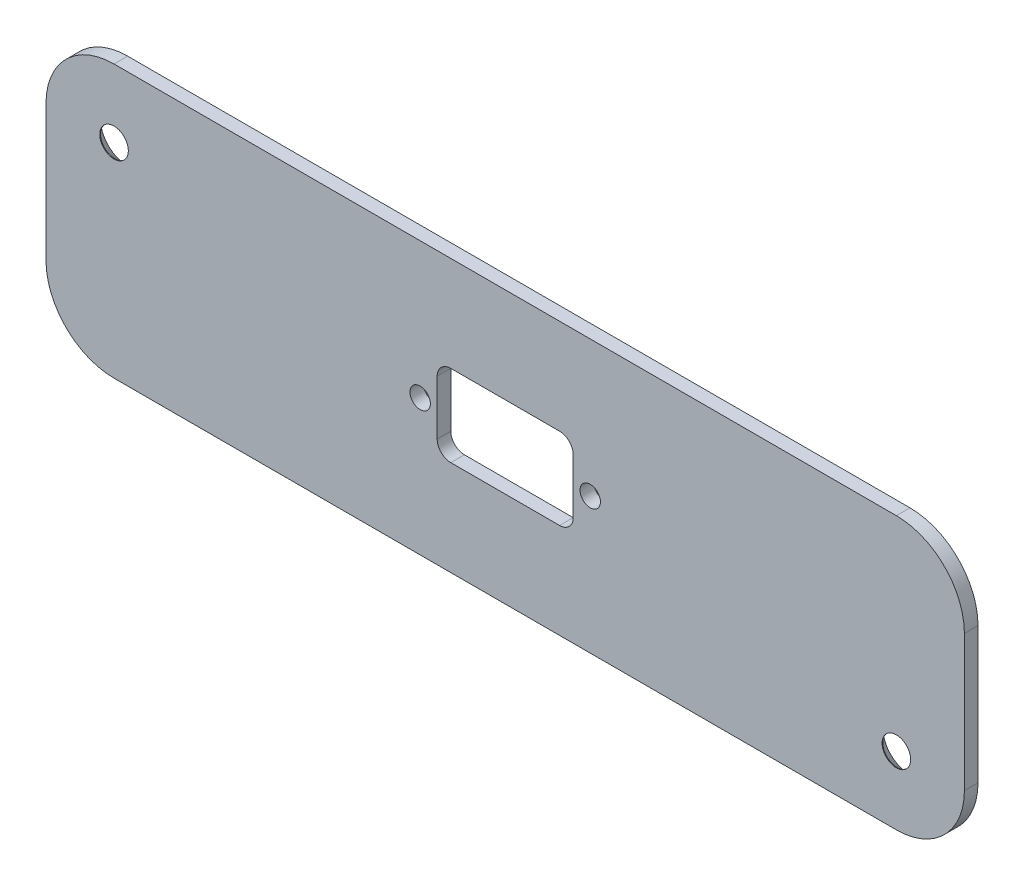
ISO-10303-21;
HEADER;
FILE_DESCRIPTION(('STEP AP214'),'2;1');
FILE_NAME('part.step','',(''),(''),'','','');
FILE_SCHEMA(('AUTOMOTIVE_DESIGN { 1 0 10303 214 1 1 1 1 }'));
ENDSEC;
DATA;
#1=APPLICATION_CONTEXT('core data for automotive mechanical design processes');
#2=APPLICATION_PROTOCOL_DEFINITION('international standard','automotive_design',2000,#1);
#3=PRODUCT_CONTEXT('',#1,'mechanical');
#4=PRODUCT('Part','Part','',(#3));
#5=PRODUCT_RELATED_PRODUCT_CATEGORY('part','',(#4));
#6=PRODUCT_DEFINITION_FORMATION('','',#4);
#7=PRODUCT_DEFINITION_CONTEXT('part definition',#1,'design');
#8=PRODUCT_DEFINITION('design','',#6,#7);
#9=PRODUCT_DEFINITION_SHAPE('','',#8);
#10=(LENGTH_UNIT() NAMED_UNIT(*) SI_UNIT(.MILLI.,.METRE.));
#11=(NAMED_UNIT(*) PLANE_ANGLE_UNIT() SI_UNIT($,.RADIAN.));
#12=(NAMED_UNIT(*) SI_UNIT($,.STERADIAN.) SOLID_ANGLE_UNIT());
#13=UNCERTAINTY_MEASURE_WITH_UNIT(LENGTH_MEASURE(1.E-05),#10,'distance_accuracy_value','');
#14=(GEOMETRIC_REPRESENTATION_CONTEXT(3) GLOBAL_UNCERTAINTY_ASSIGNED_CONTEXT((#13)) GLOBAL_UNIT_ASSIGNED_CONTEXT((#10,
#11,#12)) REPRESENTATION_CONTEXT('',''));
#15=CARTESIAN_POINT('',(0.,0.,0.));
#16=DIRECTION('',(0.,0.,1.));
#17=DIRECTION('',(1.,0.,0.));
#18=AXIS2_PLACEMENT_3D('',#15,#16,#17);
#19=CARTESIAN_POINT('',(0.,0.,0.));
#20=DIRECTION('',(0.,0.,-1.));
#21=DIRECTION('',(-1.,0.,0.));
#22=AXIS2_PLACEMENT_3D('',#19,#20,#21);
#23=PLANE('',#22);
#24=DIRECTION('',(1.,0.,0.));
#25=VECTOR('',#24,1.);
#26=CARTESIAN_POINT('',(66.6116483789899,5.38961314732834,0.));
#27=LINE('',#26,#25);
#28=CARTESIAN_POINT('',(66.6116483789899,5.38961314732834,0.));
#29=VERTEX_POINT('',#28);
#30=CARTESIAN_POINT('',(66.6565201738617,5.38961314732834,0.));
#31=VERTEX_POINT('',#30);
#32=EDGE_CURVE('E395',#29,#31,#27,.T.);
#33=ORIENTED_EDGE('',*,*,#32,.T.);
#34=DIRECTION('',(0.389639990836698,0.920967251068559,0.));
#35=VECTOR('',#34,1.);
#36=CARTESIAN_POINT('',(66.6565201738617,5.38961314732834,0.));
#37=LINE('',#36,#35);
#38=CARTESIAN_POINT('',(68.1372894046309,8.88961314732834,0.));
#39=VERTEX_POINT('',#38);
#40=EDGE_CURVE('E55',#31,#39,#37,.T.);
#41=ORIENTED_EDGE('',*,*,#40,.T.);
#42=DIRECTION('',(-1.,0.,0.));
#43=VECTOR('',#42,1.);
#44=CARTESIAN_POINT('',(68.1372894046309,8.88961314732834,0.));
#45=LINE('',#44,#43);
#46=CARTESIAN_POINT('',(67.8007509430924,8.88961314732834,0.));
#47=VERTEX_POINT('',#46);
#48=EDGE_CURVE('E385',#39,#47,#45,.T.);
#49=ORIENTED_EDGE('',*,*,#48,.T.);
#50=DIRECTION('',(-0.389563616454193,-0.920999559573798,0.));
#51=VECTOR('',#50,1.);
#52=CARTESIAN_POINT('',(67.8007509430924,8.88961314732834,0.));
#53=LINE('',#52,#51);
#54=CARTESIAN_POINT('',(66.6340842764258,6.1314000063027,0.));
#55=VERTEX_POINT('',#54);
#56=EDGE_CURVE('E410',#47,#55,#53,.T.);
#57=ORIENTED_EDGE('',*,*,#56,.T.);
#58=DIRECTION('',(-0.389563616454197,0.920999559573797,0.));
#59=VECTOR('',#58,1.);
#60=CARTESIAN_POINT('',(66.6340842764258,6.1314000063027,0.));
#61=LINE('',#60,#59);
#62=CARTESIAN_POINT('',(65.4674176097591,8.88961314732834,0.));
#63=VERTEX_POINT('',#62);
#64=EDGE_CURVE('E413',#55,#63,#61,.T.);
#65=ORIENTED_EDGE('',*,*,#64,.T.);
#66=DIRECTION('',(-1.,0.,0.));
#67=VECTOR('',#66,1.);
#68=CARTESIAN_POINT('',(65.4674176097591,8.88961314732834,0.));
#69=LINE('',#68,#67);
#70=CARTESIAN_POINT('',(65.1308791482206,8.88961314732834,0.));
#71=VERTEX_POINT('',#70);
#72=EDGE_CURVE('E416',#63,#71,#69,.T.);
#73=ORIENTED_EDGE('',*,*,#72,.T.);
#74=DIRECTION('',(0.389639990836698,-0.920967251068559,0.));
#75=VECTOR('',#74,1.);
#76=CARTESIAN_POINT('',(65.1308791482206,8.88961314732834,0.));
#77=LINE('',#76,#75);
#78=EDGE_CURVE('E419',#71,#29,#77,.T.);
#79=ORIENTED_EDGE('',*,*,#78,.T.);
#80=EDGE_LOOP('',(#33,#41,#49,#57,#65,#73,#79));
#81=FACE_BOUND('',#80,.T.);
#82=CARTESIAN_POINT('',(72.8936996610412,7.91084712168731,0.));
#83=CARTESIAN_POINT('',(72.8943354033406,7.93472852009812,0.));
#84=CARTESIAN_POINT('',(72.8955883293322,7.98179417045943,0.));
#85=CARTESIAN_POINT('',(72.906646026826,8.05079992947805,0.));
#86=CARTESIAN_POINT('',(72.9233565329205,8.11736474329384,0.));
#87=CARTESIAN_POINT('',(72.9473017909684,8.18169336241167,0.));
#88=CARTESIAN_POINT('',(72.9789085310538,8.24313901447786,0.));
#89=CARTESIAN_POINT('',(73.0173819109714,8.30177649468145,0.));
#90=CARTESIAN_POINT('',(73.0617719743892,8.35846545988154,0.));
#91=CARTESIAN_POINT('',(73.1131232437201,8.41161875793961,0.));
#92=CARTESIAN_POINT('',(73.1695347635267,8.46029996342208,0.));
#93=CARTESIAN_POINT('',(73.2291290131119,8.50342404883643,0.));
#94=CARTESIAN_POINT('',(73.2921791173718,8.53946315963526,0.));
#95=CARTESIAN_POINT('',(73.3584192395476,8.56900665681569,0.));
#96=CARTESIAN_POINT('',(73.427664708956,8.59218203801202,0.));
#97=CARTESIAN_POINT('',(73.5000494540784,8.60824061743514,0.));
#98=CARTESIAN_POINT('',(73.5753734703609,8.61832310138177,0.));
#99=CARTESIAN_POINT('',(73.6268069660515,8.61968727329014,0.));
#100=CARTESIAN_POINT('',(73.6530145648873,8.62038237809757,0.));
#101=B_SPLINE_CURVE_WITH_KNOTS('',3,(#82,#83,#84,#85,#86,#87,#88,#89,#90,#91,#92,#93,#94,#95,
#96,#97,#98,#99,#100),.UNSPECIFIED.,.F.,.F.,(4,1,1,1,1,1,1,1,1,1,1,1,1,1,1,1,4),(0.,
0.0619654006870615,0.122121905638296,0.18098849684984,0.239933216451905,0.299905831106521,
0.359988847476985,0.421775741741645,0.486575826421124,0.551534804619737,0.615017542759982,
0.677258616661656,0.739729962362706,0.80305010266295,0.866495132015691,0.931973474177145,1.),.UNSPECIFIED.);
#102=CARTESIAN_POINT('',(72.8936996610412,7.91084712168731,0.));
#103=VERTEX_POINT('',#102);
#104=CARTESIAN_POINT('',(73.6530145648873,8.62038237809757,0.));
#105=VERTEX_POINT('',#104);
#106=EDGE_CURVE('E490',#103,#105,#101,.T.);
#107=ORIENTED_EDGE('',*,*,#106,.T.);
#108=CARTESIAN_POINT('',(73.6530145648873,8.62038237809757,0.));
#109=CARTESIAN_POINT('',(73.6803853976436,8.61966734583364,0.));
#110=CARTESIAN_POINT('',(73.7341371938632,8.61826314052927,0.));
#111=CARTESIAN_POINT('',(73.8130562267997,8.60844047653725,0.));
#112=CARTESIAN_POINT('',(73.8883420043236,8.59149463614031,0.));
#113=CARTESIAN_POINT('',(73.9601839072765,8.56831796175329,0.));
#114=CARTESIAN_POINT('',(74.0287034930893,8.53885941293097,0.));
#115=CARTESIAN_POINT('',(74.0935675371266,8.50216766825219,0.));
#116=CARTESIAN_POINT('',(74.1546304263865,8.45838417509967,0.));
#117=CARTESIAN_POINT('',(74.212006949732,8.40874361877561,0.));
#118=CARTESIAN_POINT('',(74.2648709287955,8.35347601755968,0.));
#119=CARTESIAN_POINT('',(74.3113178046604,8.29186605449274,0.));
#120=CARTESIAN_POINT('',(74.3519018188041,8.22503863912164,0.));
#121=CARTESIAN_POINT('',(74.3873110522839,8.1531740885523,0.));
#122=CARTESIAN_POINT('',(74.4160667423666,8.07562030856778,0.));
#123=CARTESIAN_POINT('',(74.4380398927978,7.99265260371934,0.));
#124=CARTESIAN_POINT('',(74.4554267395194,7.90463122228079,0.));
#125=CARTESIAN_POINT('',(74.4612352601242,7.84384613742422,0.));
#126=CARTESIAN_POINT('',(74.464212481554,7.81269007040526,0.));
#127=B_SPLINE_CURVE_WITH_KNOTS('',3,(#108,#109,#110,#111,#112,#113,#114,#115,#116,#117,#118,
#119,#120,#121,#122,#123,#124,#125,#126),.UNSPECIFIED.,.F.,.F.,(4,1,1,1,1,1,1,1,1,1,1,1,1,1,1,1,
4),(0.,0.0644386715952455,0.126546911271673,0.18688715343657,0.245877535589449,
0.304040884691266,0.362191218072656,0.420975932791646,0.480660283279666,0.540600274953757,
0.600689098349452,0.661935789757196,0.724442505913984,0.789038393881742,0.856313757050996,
0.926352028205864,1.),.UNSPECIFIED.);
#128=CARTESIAN_POINT('',(74.464212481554,7.81269007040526,0.));
#129=VERTEX_POINT('',#128);
#130=EDGE_CURVE('E482',#105,#129,#127,.T.);
#131=ORIENTED_EDGE('',*,*,#130,.T.);
#132=DIRECTION('',(1.,0.,0.));
#133=VECTOR('',#132,1.);
#134=CARTESIAN_POINT('',(74.464212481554,7.81269007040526,0.));
#135=LINE('',#134,#133);
#136=CARTESIAN_POINT('',(74.7783150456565,7.81269007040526,0.));
#137=VERTEX_POINT('',#136);
#138=EDGE_CURVE('E843',#129,#137,#135,.T.);
#139=ORIENTED_EDGE('',*,*,#138,.T.);
#140=CARTESIAN_POINT('',(74.7783150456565,7.81269007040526,0.));
#141=CARTESIAN_POINT('',(74.7762678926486,7.85436095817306,0.));
#142=CARTESIAN_POINT('',(74.7722473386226,7.93620147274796,0.));
#143=CARTESIAN_POINT('',(74.7534190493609,8.05552537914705,0.));
#144=CARTESIAN_POINT('',(74.726478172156,8.16958017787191,0.));
#145=CARTESIAN_POINT('',(74.6883867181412,8.27745009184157,0.));
#146=CARTESIAN_POINT('',(74.6410804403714,8.3800888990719,0.));
#147=CARTESIAN_POINT('',(74.5843504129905,8.47708891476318,0.));
#148=CARTESIAN_POINT('',(74.5171565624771,8.56808010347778,0.));
#149=CARTESIAN_POINT('',(74.4409498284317,8.65221894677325,0.));
#150=CARTESIAN_POINT('',(74.3581811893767,8.72940651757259,0.));
#151=CARTESIAN_POINT('',(74.2688752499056,8.79606176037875,0.));
#152=CARTESIAN_POINT('',(74.1750302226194,8.85237943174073,0.));
#153=CARTESIAN_POINT('',(74.0769308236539,8.89946067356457,0.));
#154=CARTESIAN_POINT('',(73.9734702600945,8.9348005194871,0.));
#155=CARTESIAN_POINT('',(73.865587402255,8.96102215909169,0.));
#156=CARTESIAN_POINT('',(73.7528082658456,8.97679850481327,0.));
#157=CARTESIAN_POINT('',(73.6759682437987,8.97849429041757,0.));
#158=CARTESIAN_POINT('',(73.6368887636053,8.97935673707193,0.));
#159=B_SPLINE_CURVE_WITH_KNOTS('',3,(#140,#141,#142,#143,#144,#145,#146,#147,#148,#149,#150,
#151,#152,#153,#154,#155,#156,#157,#158),.UNSPECIFIED.,.F.,.F.,(4,1,1,1,1,1,1,1,1,1,1,1,1,1,1,1,
4),(0.,0.0687907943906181,0.135103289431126,0.198978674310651,0.261904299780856,
0.323494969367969,0.38519537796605,0.446969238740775,0.509764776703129,0.572250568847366,
0.633405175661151,0.693251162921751,0.752583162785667,0.812579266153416,0.873275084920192,
0.935549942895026,1.),.UNSPECIFIED.);
#160=CARTESIAN_POINT('',(73.6368887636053,8.97935673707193,0.));
#161=VERTEX_POINT('',#160);
#162=EDGE_CURVE('E835',#137,#161,#159,.T.);
#163=ORIENTED_EDGE('',*,*,#162,.T.);
#164=CARTESIAN_POINT('',(73.6368887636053,8.97935673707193,0.));
#165=CARTESIAN_POINT('',(73.5985106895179,8.9784582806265,0.));
#166=CARTESIAN_POINT('',(73.5230991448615,8.97669284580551,0.));
#167=CARTESIAN_POINT('',(73.4130371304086,8.96153181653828,0.));
#168=CARTESIAN_POINT('',(73.3082598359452,8.93778622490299,0.));
#169=CARTESIAN_POINT('',(73.2089720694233,8.9044708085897,0.));
#170=CARTESIAN_POINT('',(73.1159660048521,8.85968638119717,0.));
#171=CARTESIAN_POINT('',(73.0285429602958,8.80588884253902,0.));
#172=CARTESIAN_POINT('',(72.9456621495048,8.74366901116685,0.));
#173=CARTESIAN_POINT('',(72.8710553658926,8.67041519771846,0.));
#174=CARTESIAN_POINT('',(72.8025472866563,8.5922128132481,0.));
#175=CARTESIAN_POINT('',(72.7434450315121,8.50872490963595,0.));
#176=CARTESIAN_POINT('',(72.6928318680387,8.42249562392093,0.));
#177=CARTESIAN_POINT('',(72.6506441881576,8.33286742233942,0.));
#178=CARTESIAN_POINT('',(72.6195880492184,8.23899639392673,0.));
#179=CARTESIAN_POINT('',(72.5960098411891,8.14224919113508,0.));
#180=CARTESIAN_POINT('',(72.5826824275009,8.04162438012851,0.));
#181=CARTESIAN_POINT('',(72.5806370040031,7.97351782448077,0.));
#182=CARTESIAN_POINT('',(72.5795970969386,7.93889199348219,0.));
#183=B_SPLINE_CURVE_WITH_KNOTS('',3,(#164,#165,#166,#167,#168,#169,#170,#171,#172,#173,#174,
#175,#176,#177,#178,#179,#180,#181,#182),.UNSPECIFIED.,.F.,.F.,(4,1,1,1,1,1,1,1,1,1,1,1,1,1,1,1,
4),(0.,0.0694754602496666,0.136516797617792,0.200788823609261,0.263829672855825,
0.325735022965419,0.387290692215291,0.449509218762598,0.512967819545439,0.576275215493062,
0.637580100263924,0.697902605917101,0.757172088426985,0.816598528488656,0.87665317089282,
0.93728964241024,1.),.UNSPECIFIED.);
#184=CARTESIAN_POINT('',(72.5795970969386,7.93889199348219,0.));
#185=VERTEX_POINT('',#184);
#186=EDGE_CURVE('E827',#161,#185,#183,.T.);
#187=ORIENTED_EDGE('',*,*,#186,.T.);
#188=CARTESIAN_POINT('',(72.5795970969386,7.93889199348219,0.));
#189=CARTESIAN_POINT('',(72.5812903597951,7.89014415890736,0.));
#190=CARTESIAN_POINT('',(72.5846471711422,7.79350394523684,0.));
#191=CARTESIAN_POINT('',(72.6133615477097,7.65148908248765,0.));
#192=CARTESIAN_POINT('',(72.6582080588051,7.51389566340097,0.));
#193=CARTESIAN_POINT('',(72.7122054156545,7.40315836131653,0.));
#194=CARTESIAN_POINT('',(72.7666778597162,7.3139248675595,0.));
#195=CARTESIAN_POINT('',(72.8157653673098,7.24045616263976,0.));
#196=CARTESIAN_POINT('',(72.8732301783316,7.16135069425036,0.));
#197=CARTESIAN_POINT('',(72.9399086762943,7.0768733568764,0.));
#198=CARTESIAN_POINT('',(73.014421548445,6.98636245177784,0.));
#199=CARTESIAN_POINT('',(73.0974437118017,6.88987265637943,0.));
#200=CARTESIAN_POINT('',(73.1895671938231,6.78840088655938,0.));
#201=CARTESIAN_POINT('',(73.2542256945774,6.71909528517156,0.));
#202=CARTESIAN_POINT('',(73.2877301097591,6.6831828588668,0.));
#203=B_SPLINE_CURVE_WITH_KNOTS('',3,(#188,#189,#190,#191,#192,#193,#194,#195,#196,#197,#198,
#199,#200,#201,#202),.UNSPECIFIED.,.F.,.F.,(4,1,1,1,1,1,1,1,1,1,1,1,4),(0.,0.0987021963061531,
0.195672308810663,0.292422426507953,0.391342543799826,0.444462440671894,0.504228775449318,
0.570352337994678,0.642545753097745,0.722287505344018,0.807921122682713,0.900469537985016,1.),.UNSPECIFIED.);
#204=CARTESIAN_POINT('',(73.2877301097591,6.6831828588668,0.));
#205=VERTEX_POINT('',#204);
#206=EDGE_CURVE('E822',#185,#205,#203,.T.);
#207=ORIENTED_EDGE('',*,*,#206,.T.);
#208=DIRECTION('',(0.683740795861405,-0.729724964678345,0.));
#209=VECTOR('',#208,1.);
#210=CARTESIAN_POINT('',(73.2877301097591,6.6831828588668,0.));
#211=LINE('',#210,#209);
#212=CARTESIAN_POINT('',(74.163431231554,5.7485875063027,0.));
#213=VERTEX_POINT('',#212);
#214=EDGE_CURVE('E819',#205,#213,#211,.T.);
#215=ORIENTED_EDGE('',*,*,#214,.T.);
#216=DIRECTION('',(-1.,0.,0.));
#217=VECTOR('',#216,1.);
#218=CARTESIAN_POINT('',(74.163431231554,5.7485875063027,0.));
#219=LINE('',#218,#217);
#220=CARTESIAN_POINT('',(72.5347253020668,5.7485875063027,0.));
#221=VERTEX_POINT('',#220);
#222=EDGE_CURVE('E816',#213,#221,#219,.T.);
#223=ORIENTED_EDGE('',*,*,#222,.T.);
#224=DIRECTION('',(0.,-1.,0.));
#225=VECTOR('',#224,1.);
#226=CARTESIAN_POINT('',(72.5347253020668,5.7485875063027,0.));
#227=LINE('',#226,#225);
#228=CARTESIAN_POINT('',(72.5347253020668,5.38961314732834,0.));
#229=VERTEX_POINT('',#228);
#230=EDGE_CURVE('E813',#221,#229,#227,.T.);
#231=ORIENTED_EDGE('',*,*,#230,.T.);
#232=DIRECTION('',(1.,0.,0.));
#233=VECTOR('',#232,1.);
#234=CARTESIAN_POINT('',(72.5347253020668,5.38961314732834,0.));
#235=LINE('',#234,#233);
#236=CARTESIAN_POINT('',(74.9129304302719,5.38961314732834,0.));
#237=VERTEX_POINT('',#236);
#238=EDGE_CURVE('E810',#229,#237,#235,.T.);
#239=ORIENTED_EDGE('',*,*,#238,.T.);
#240=DIRECTION('',(-0.683776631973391,0.729691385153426,0.));
#241=VECTOR('',#240,1.);
#242=CARTESIAN_POINT('',(74.9129304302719,5.38961314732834,0.));
#243=LINE('',#242,#241);
#244=CARTESIAN_POINT('',(73.5555586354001,6.83813077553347,0.));
#245=VERTEX_POINT('',#244);
#246=EDGE_CURVE('E804',#237,#245,#243,.T.);
#247=ORIENTED_EDGE('',*,*,#246,.T.);
#248=CARTESIAN_POINT('',(73.5555586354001,6.83813077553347,0.));
#249=CARTESIAN_POINT('',(73.5225107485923,6.87262908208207,0.));
#250=CARTESIAN_POINT('',(73.4590325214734,6.93889326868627,0.));
#251=CARTESIAN_POINT('',(73.3692499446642,7.03563622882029,0.));
#252=CARTESIAN_POINT('',(73.2886109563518,7.12538576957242,0.));
#253=CARTESIAN_POINT('',(73.21659356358,7.2079723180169,0.));
#254=CARTESIAN_POINT('',(73.1547600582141,7.28460388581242,0.));
#255=CARTESIAN_POINT('',(73.0998878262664,7.35279858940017,0.));
#256=CARTESIAN_POINT('',(73.0559222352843,7.41555303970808,0.));
#257=CARTESIAN_POINT('',(73.0082068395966,7.4882936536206,0.));
#258=CARTESIAN_POINT('',(72.9619928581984,7.57710597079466,0.));
#259=CARTESIAN_POINT('',(72.922280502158,7.68563966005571,0.));
#260=CARTESIAN_POINT('',(72.8980656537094,7.7973669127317,0.));
#261=CARTESIAN_POINT('',(72.8951608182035,7.87286894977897,0.));
#262=CARTESIAN_POINT('',(72.8936996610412,7.91084712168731,0.));
#263=B_SPLINE_CURVE_WITH_KNOTS('',3,(#248,#249,#250,#251,#252,#253,#254,#255,#256,#257,#258,
#259,#260,#261,#262),.UNSPECIFIED.,.F.,.F.,(4,1,1,1,1,1,1,1,1,1,1,1,4),(0.,0.110802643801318,
0.212829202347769,0.306101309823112,0.390647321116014,0.466924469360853,0.534481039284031,
0.593586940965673,0.644557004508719,0.736200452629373,0.825024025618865,0.911985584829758,1.),.UNSPECIFIED.);
#264=EDGE_CURVE('E796',#245,#103,#263,.T.);
#265=ORIENTED_EDGE('',*,*,#264,.T.);
#266=EDGE_LOOP('',(#107,#131,#139,#163,#187,#207,#215,#223,#231,#239,#247,#265));
#267=FACE_BOUND('',#266,.T.);
#268=CARTESIAN_POINT('',(55.,20.,0.));
#269=DIRECTION('',(0.,0.,-1.));
#270=DIRECTION('',(-1.,0.,0.));
#271=AXIS2_PLACEMENT_3D('',#268,#269,#270);
#272=CIRCLE('',#271,1.5);
#273=CARTESIAN_POINT('',(53.5,20.,0.));
#274=VERTEX_POINT('',#273);
#275=EDGE_CURVE('E760',#274,#274,#272,.T.);
#276=ORIENTED_EDGE('',*,*,#275,.F.);
#277=EDGE_LOOP('',(#276));
#278=FACE_BOUND('',#277,.T.);
#279=CARTESIAN_POINT('',(80.,20.,0.));
#280=DIRECTION('',(0.,0.,-1.));
#281=DIRECTION('',(-1.,0.,0.));
#282=AXIS2_PLACEMENT_3D('',#279,#280,#281);
#283=CIRCLE('',#282,1.5);
#284=CARTESIAN_POINT('',(78.5,20.,0.));
#285=VERTEX_POINT('',#284);
#286=EDGE_CURVE('E754',#285,#285,#283,.T.);
#287=ORIENTED_EDGE('',*,*,#286,.F.);
#288=EDGE_LOOP('',(#287));
#289=FACE_BOUND('',#288,.T.);
#290=DIRECTION('',(0.,-1.,0.));
#291=VECTOR('',#290,1.);
#292=CARTESIAN_POINT('',(77.5,26.,0.));
#293=LINE('',#292,#291);
#294=CARTESIAN_POINT('',(77.5,24.,0.));
#295=VERTEX_POINT('',#294);
#296=CARTESIAN_POINT('',(77.5,16.,0.));
#297=VERTEX_POINT('',#296);
#298=EDGE_CURVE('E740',#295,#297,#293,.T.);
#299=ORIENTED_EDGE('',*,*,#298,.F.);
#300=CARTESIAN_POINT('',(75.5,24.,0.));
#301=DIRECTION('',(0.,0.,-1.));
#302=DIRECTION('',(-1.,0.,0.));
#303=AXIS2_PLACEMENT_3D('',#300,#301,#302);
#304=CIRCLE('',#303,2.);
#305=CARTESIAN_POINT('',(75.5,26.,0.));
#306=VERTEX_POINT('',#305);
#307=EDGE_CURVE('E682',#295,#306,#304,.F.);
#308=ORIENTED_EDGE('',*,*,#307,.T.);
#309=DIRECTION('',(1.,0.,0.));
#310=VECTOR('',#309,1.);
#311=CARTESIAN_POINT('',(77.5,26.,0.));
#312=LINE('',#311,#310);
#313=CARTESIAN_POINT('',(59.5,26.,0.));
#314=VERTEX_POINT('',#313);
#315=EDGE_CURVE('E730',#314,#306,#312,.T.);
#316=ORIENTED_EDGE('',*,*,#315,.F.);
#317=CARTESIAN_POINT('',(59.5,24.,0.));
#318=DIRECTION('',(0.,0.,-1.));
#319=DIRECTION('',(-1.,0.,0.));
#320=AXIS2_PLACEMENT_3D('',#317,#318,#319);
#321=CIRCLE('',#320,2.);
#322=CARTESIAN_POINT('',(57.5,24.,0.));
#323=VERTEX_POINT('',#322);
#324=EDGE_CURVE('E678',#314,#323,#321,.F.);
#325=ORIENTED_EDGE('',*,*,#324,.T.);
#326=DIRECTION('',(0.,1.,0.));
#327=VECTOR('',#326,1.);
#328=CARTESIAN_POINT('',(57.5,26.,0.));
#329=LINE('',#328,#327);
#330=CARTESIAN_POINT('',(57.5,16.,0.));
#331=VERTEX_POINT('',#330);
#332=EDGE_CURVE('E734',#331,#323,#329,.T.);
#333=ORIENTED_EDGE('',*,*,#332,.F.);
#334=CARTESIAN_POINT('',(59.5,16.,0.));
#335=DIRECTION('',(0.,0.,-1.));
#336=DIRECTION('',(-1.,0.,0.));
#337=AXIS2_PLACEMENT_3D('',#334,#335,#336);
#338=CIRCLE('',#337,2.);
#339=CARTESIAN_POINT('',(59.5,14.,0.));
#340=VERTEX_POINT('',#339);
#341=EDGE_CURVE('E674',#331,#340,#338,.F.);
#342=ORIENTED_EDGE('',*,*,#341,.T.);
#343=DIRECTION('',(-1.,0.,0.));
#344=VECTOR('',#343,1.);
#345=CARTESIAN_POINT('',(77.5,14.,0.));
#346=LINE('',#345,#344);
#347=CARTESIAN_POINT('',(75.5,14.,0.));
#348=VERTEX_POINT('',#347);
#349=EDGE_CURVE('E737',#348,#340,#346,.T.);
#350=ORIENTED_EDGE('',*,*,#349,.F.);
#351=CARTESIAN_POINT('',(75.5,16.,0.));
#352=DIRECTION('',(0.,0.,-1.));
#353=DIRECTION('',(-1.,0.,0.));
#354=AXIS2_PLACEMENT_3D('',#351,#352,#353);
#355=CIRCLE('',#354,2.);
#356=EDGE_CURVE('E686',#348,#297,#355,.F.);
#357=ORIENTED_EDGE('',*,*,#356,.T.);
#358=EDGE_LOOP('',(#299,#308,#316,#325,#333,#342,#350,#357));
#359=FACE_BOUND('',#358,.T.);
#360=CARTESIAN_POINT('',(10.,30.,0.));
#361=DIRECTION('',(0.,0.,-1.));
#362=DIRECTION('',(-1.,0.,0.));
#363=AXIS2_PLACEMENT_3D('',#360,#361,#362);
#364=CIRCLE('',#363,3.99999999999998);
#365=CARTESIAN_POINT('',(6.00000000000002,30.,0.));
#366=VERTEX_POINT('',#365);
#367=EDGE_CURVE('E645',#366,#366,#364,.F.);
#368=ORIENTED_EDGE('',*,*,#367,.T.);
#369=EDGE_LOOP('',(#368));
#370=FACE_BOUND('',#369,.T.);
#371=CARTESIAN_POINT('',(125.,10.,0.));
#372=DIRECTION('',(0.,0.,-1.));
#373=DIRECTION('',(-1.,0.,0.));
#374=AXIS2_PLACEMENT_3D('',#371,#372,#373);
#375=CIRCLE('',#374,4.);
#376=CARTESIAN_POINT('',(121.,10.,0.));
#377=VERTEX_POINT('',#376);
#378=EDGE_CURVE('E642',#377,#377,#375,.F.);
#379=ORIENTED_EDGE('',*,*,#378,.T.);
#380=EDGE_LOOP('',(#379));
#381=FACE_BOUND('',#380,.T.);
#382=DIRECTION('',(0.,1.,0.));
#383=VECTOR('',#382,1.);
#384=CARTESIAN_POINT('',(135.,0.,0.));
#385=LINE('',#384,#383);
#386=CARTESIAN_POINT('',(135.,10.,0.));
#387=VERTEX_POINT('',#386);
#388=CARTESIAN_POINT('',(135.,30.,0.));
#389=VERTEX_POINT('',#388);
#390=EDGE_CURVE('E634',#387,#389,#385,.T.);
#391=ORIENTED_EDGE('',*,*,#390,.F.);
#392=CARTESIAN_POINT('',(125.,10.,0.));
#393=DIRECTION('',(0.,0.,-1.));
#394=DIRECTION('',(-1.,0.,0.));
#395=AXIS2_PLACEMENT_3D('',#392,#393,#394);
#396=CIRCLE('',#395,10.);
#397=CARTESIAN_POINT('',(125.,0.,0.));
#398=VERTEX_POINT('',#397);
#399=EDGE_CURVE('E699',#387,#398,#396,.T.);
#400=ORIENTED_EDGE('',*,*,#399,.T.);
#401=DIRECTION('',(1.,0.,0.));
#402=VECTOR('',#401,1.);
#403=CARTESIAN_POINT('',(0.,0.,0.));
#404=LINE('',#403,#402);
#405=CARTESIAN_POINT('',(10.,0.,0.));
#406=VERTEX_POINT('',#405);
#407=EDGE_CURVE('E638',#406,#398,#404,.T.);
#408=ORIENTED_EDGE('',*,*,#407,.F.);
#409=CARTESIAN_POINT('',(10.,10.,0.));
#410=DIRECTION('',(0.,0.,-1.));
#411=DIRECTION('',(-1.,0.,0.));
#412=AXIS2_PLACEMENT_3D('',#409,#410,#411);
#413=CIRCLE('',#412,10.);
#414=CARTESIAN_POINT('',(0.,10.,0.));
#415=VERTEX_POINT('',#414);
#416=EDGE_CURVE('E697',#406,#415,#413,.T.);
#417=ORIENTED_EDGE('',*,*,#416,.T.);
#418=DIRECTION('',(0.,-1.,0.));
#419=VECTOR('',#418,1.);
#420=CARTESIAN_POINT('',(0.,0.,0.));
#421=LINE('',#420,#419);
#422=CARTESIAN_POINT('',(0.,30.,0.));
#423=VERTEX_POINT('',#422);
#424=EDGE_CURVE('E718',#423,#415,#421,.T.);
#425=ORIENTED_EDGE('',*,*,#424,.F.);
#426=CARTESIAN_POINT('',(10.,30.,0.));
#427=DIRECTION('',(0.,0.,-1.));
#428=DIRECTION('',(-1.,0.,0.));
#429=AXIS2_PLACEMENT_3D('',#426,#427,#428);
#430=CIRCLE('',#429,10.);
#431=CARTESIAN_POINT('',(10.,40.,0.));
#432=VERTEX_POINT('',#431);
#433=EDGE_CURVE('E632',#423,#432,#430,.T.);
#434=ORIENTED_EDGE('',*,*,#433,.T.);
#435=DIRECTION('',(-1.,0.,0.));
#436=VECTOR('',#435,1.);
#437=CARTESIAN_POINT('',(0.,40.,0.));
#438=LINE('',#437,#436);
#439=CARTESIAN_POINT('',(125.,40.,0.));
#440=VERTEX_POINT('',#439);
#441=EDGE_CURVE('E623',#440,#432,#438,.T.);
#442=ORIENTED_EDGE('',*,*,#441,.F.);
#443=CARTESIAN_POINT('',(125.,30.,0.));
#444=DIRECTION('',(0.,0.,-1.));
#445=DIRECTION('',(-1.,0.,0.));
#446=AXIS2_PLACEMENT_3D('',#443,#444,#445);
#447=CIRCLE('',#446,10.);
#448=EDGE_CURVE('E629',#440,#389,#447,.T.);
#449=ORIENTED_EDGE('',*,*,#448,.T.);
#450=EDGE_LOOP('',(#391,#400,#408,#417,#425,#434,#442,#449));
#451=FACE_BOUND('',#450,.T.);
#452=DIRECTION('',(1.,0.,0.));
#453=VECTOR('',#452,1.);
#454=CARTESIAN_POINT('',(70.3738679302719,8.53063878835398,0.));
#455=LINE('',#454,#453);
#456=CARTESIAN_POINT('',(70.3738679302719,8.53063878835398,0.));
#457=VERTEX_POINT('',#456);
#458=CARTESIAN_POINT('',(71.9962637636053,8.53063878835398,0.));
#459=VERTEX_POINT('',#458);
#460=EDGE_CURVE('E442',#457,#459,#455,.T.);
#461=ORIENTED_EDGE('',*,*,#460,.T.);
#462=DIRECTION('',(0.,1.,0.));
#463=VECTOR('',#462,1.);
#464=CARTESIAN_POINT('',(71.9962637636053,8.53063878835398,0.));
#465=LINE('',#464,#463);
#466=CARTESIAN_POINT('',(71.9962637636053,8.88961314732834,0.));
#467=VERTEX_POINT('',#466);
#468=EDGE_CURVE('E437',#459,#467,#465,.T.);
#469=ORIENTED_EDGE('',*,*,#468,.T.);
#470=DIRECTION('',(-1.,0.,0.));
#471=VECTOR('',#470,1.);
#472=CARTESIAN_POINT('',(71.9962637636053,8.88961314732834,0.));
#473=LINE('',#472,#471);
#474=CARTESIAN_POINT('',(69.8424176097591,8.88961314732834,0.));
#475=VERTEX_POINT('',#474);
#476=EDGE_CURVE('E455',#467,#475,#473,.T.);
#477=ORIENTED_EDGE('',*,*,#476,.T.);
#478=DIRECTION('',(0.456090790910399,-0.889933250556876,0.));
#479=VECTOR('',#478,1.);
#480=CARTESIAN_POINT('',(69.8424176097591,8.88961314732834,0.));
#481=LINE('',#480,#479);
#482=CARTESIAN_POINT('',(71.6821611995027,5.29986955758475,0.));
#483=VERTEX_POINT('',#482);
#484=EDGE_CURVE('E458',#475,#483,#481,.T.);
#485=ORIENTED_EDGE('',*,*,#484,.T.);
#486=DIRECTION('',(0.876072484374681,0.482179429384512,0.));
#487=VECTOR('',#486,1.);
#488=CARTESIAN_POINT('',(71.6821611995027,5.29986955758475,0.));
#489=LINE('',#488,#487);
#490=CARTESIAN_POINT('',(71.9534953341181,5.44920849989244,0.));
#491=VERTEX_POINT('',#490);
#492=EDGE_CURVE('E461',#483,#491,#489,.T.);
#493=ORIENTED_EDGE('',*,*,#492,.T.);
#494=DIRECTION('',(-0.456180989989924,0.889887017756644,0.));
#495=VECTOR('',#494,1.);
#496=CARTESIAN_POINT('',(71.9534953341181,5.44920849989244,0.));
#497=LINE('',#496,#495);
#498=EDGE_CURVE('E464',#491,#457,#497,.T.);
#499=ORIENTED_EDGE('',*,*,#498,.T.);
#500=EDGE_LOOP('',(#461,#469,#477,#485,#493,#499));
#501=FACE_BOUND('',#500,.T.);
#502=CARTESIAN_POINT('',(64.6821611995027,7.15994567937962,0.));
#503=CARTESIAN_POINT('',(64.6806060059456,7.2229011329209,0.));
#504=CARTESIAN_POINT('',(64.6775462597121,7.34676205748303,0.));
#505=CARTESIAN_POINT('',(64.6515504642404,7.52853601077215,0.));
#506=CARTESIAN_POINT('',(64.6097316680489,7.7026874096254,0.));
#507=CARTESIAN_POINT('',(64.5503347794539,7.86889115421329,0.));
#508=CARTESIAN_POINT('',(64.4750294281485,8.02802143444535,0.));
#509=CARTESIAN_POINT('',(64.382002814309,8.1788626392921,0.));
#510=CARTESIAN_POINT('',(64.2723356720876,8.32237943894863,0.));
#511=CARTESIAN_POINT('',(64.146888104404,8.45639419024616,0.));
#512=CARTESIAN_POINT('',(64.0093207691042,8.57893354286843,0.));
#513=CARTESIAN_POINT('',(63.8620019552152,8.68673974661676,0.));
#514=CARTESIAN_POINT('',(63.7052200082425,8.77645726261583,0.));
#515=CARTESIAN_POINT('',(63.540702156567,8.85145342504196,0.));
#516=CARTESIAN_POINT('',(63.3672164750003,8.9090978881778,0.));
#517=CARTESIAN_POINT('',(63.1851331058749,8.94945107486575,0.));
#518=CARTESIAN_POINT('',(62.9947941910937,8.97456819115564,0.));
#519=CARTESIAN_POINT('',(62.8649317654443,8.97774339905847,0.));
#520=CARTESIAN_POINT('',(62.7989480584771,8.97935673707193,0.));
#521=B_SPLINE_CURVE_WITH_KNOTS('',3,(#502,#503,#504,#505,#506,#507,#508,#509,#510,#511,#512,
#513,#514,#515,#516,#517,#518,#519,#520),.UNSPECIFIED.,.F.,.F.,(4,1,1,1,1,1,1,1,1,1,1,1,1,1,1,1,
4),(0.,0.0645578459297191,0.127013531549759,0.187954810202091,0.248013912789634,
0.307747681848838,0.368234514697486,0.429469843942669,0.492743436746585,0.556257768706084,
0.618216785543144,0.679655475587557,0.741245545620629,0.803415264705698,0.866815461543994,
0.932328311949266,1.),.UNSPECIFIED.);
#522=CARTESIAN_POINT('',(64.6821611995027,7.15994567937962,0.));
#523=VERTEX_POINT('',#522);
#524=CARTESIAN_POINT('',(62.7989480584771,8.97935673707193,0.));
#525=VERTEX_POINT('',#524);
#526=EDGE_CURVE('E378',#523,#525,#521,.T.);
#527=ORIENTED_EDGE('',*,*,#526,.T.);
#528=CARTESIAN_POINT('',(62.7989480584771,8.97935673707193,0.));
#529=CARTESIAN_POINT('',(62.7587335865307,8.97887459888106,0.));
#530=CARTESIAN_POINT('',(62.6791330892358,8.97792025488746,0.));
#531=CARTESIAN_POINT('',(62.5613804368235,8.96861411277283,0.));
#532=CARTESIAN_POINT('',(62.4467381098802,8.95310050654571,0.));
#533=CARTESIAN_POINT('',(62.3351271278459,8.9319844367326,0.));
#534=CARTESIAN_POINT('',(62.226004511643,8.90577711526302,0.));
#535=CARTESIAN_POINT('',(62.1202042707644,8.87163681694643,0.));
#536=CARTESIAN_POINT('',(62.0171055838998,8.83260028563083,0.));
#537=CARTESIAN_POINT('',(61.9173586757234,8.78764181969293,0.));
#538=CARTESIAN_POINT('',(61.8214421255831,8.73717507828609,0.));
#539=CARTESIAN_POINT('',(61.7293858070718,8.68175945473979,0.));
#540=CARTESIAN_POINT('',(61.6419209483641,8.62146364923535,0.));
#541=CARTESIAN_POINT('',(61.5584320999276,8.55680047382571,0.));
#542=CARTESIAN_POINT('',(61.4803158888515,8.4864019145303,0.));
#543=CARTESIAN_POINT('',(61.4053544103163,8.41220431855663,0.));
#544=CARTESIAN_POINT('',(61.3360933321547,8.3320704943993,0.));
#545=CARTESIAN_POINT('',(61.2933401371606,8.27566556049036,0.));
#546=CARTESIAN_POINT('',(61.2719047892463,8.24738558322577,0.));
#547=B_SPLINE_CURVE_WITH_KNOTS('',3,(#528,#529,#530,#531,#532,#533,#534,#535,#536,#537,#538,
#539,#540,#541,#542,#543,#544,#545,#546),.UNSPECIFIED.,.F.,.F.,(4,1,1,1,1,1,1,1,1,1,1,1,1,1,1,1,
4),(0.,0.0685475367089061,0.135682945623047,0.201214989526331,0.265682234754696,
0.32926683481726,0.392395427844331,0.455069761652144,0.517126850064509,0.578790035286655,
0.639739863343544,0.700191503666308,0.759806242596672,0.819628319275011,0.879354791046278,
0.939511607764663,1.),.UNSPECIFIED.);
#548=CARTESIAN_POINT('',(61.2719047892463,8.24738558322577,0.));
#549=VERTEX_POINT('',#548);
#550=EDGE_CURVE('E47',#525,#549,#547,.T.);
#551=ORIENTED_EDGE('',*,*,#550,.T.);
#552=DIRECTION('',(0.794127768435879,-0.607750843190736,0.));
#553=VECTOR('',#552,1.);
#554=CARTESIAN_POINT('',(61.2719047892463,8.24738558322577,0.));
#555=LINE('',#554,#553);
#556=CARTESIAN_POINT('',(61.546744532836,8.03704904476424,0.));
#557=VERTEX_POINT('',#556);
#558=EDGE_CURVE('E382',#549,#557,#555,.T.);
#559=ORIENTED_EDGE('',*,*,#558,.T.);
#560=CARTESIAN_POINT('',(61.546744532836,8.03704904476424,0.));
#561=CARTESIAN_POINT('',(61.5663504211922,8.06041501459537,0.));
#562=CARTESIAN_POINT('',(61.6052978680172,8.10683193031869,0.));
#563=CARTESIAN_POINT('',(61.667957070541,8.17201147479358,0.));
#564=CARTESIAN_POINT('',(61.7332587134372,8.23307673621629,0.));
#565=CARTESIAN_POINT('',(61.8011778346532,8.29031861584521,0.));
#566=CARTESIAN_POINT('',(61.8729369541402,8.34173538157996,0.));
#567=CARTESIAN_POINT('',(61.9467977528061,8.39000648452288,0.));
#568=CARTESIAN_POINT('',(62.0239957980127,8.43327422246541,0.));
#569=CARTESIAN_POINT('',(62.1307475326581,8.48573720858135,0.));
#570=CARTESIAN_POINT('',(62.2703953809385,8.54048336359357,0.));
#571=CARTESIAN_POINT('',(62.4461902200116,8.58638659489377,0.));
#572=CARTESIAN_POINT('',(62.6297013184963,8.61560777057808,0.));
#573=CARTESIAN_POINT('',(62.7548989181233,8.61877261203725,0.));
#574=CARTESIAN_POINT('',(62.8185794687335,8.62038237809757,0.));
#575=B_SPLINE_CURVE_WITH_KNOTS('',3,(#560,#561,#562,#563,#564,#565,#566,#567,#568,#569,#570,
#571,#572,#573,#574),.UNSPECIFIED.,.F.,.F.,(4,1,1,1,1,1,1,1,1,1,1,1,4),(0.,0.0631632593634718,
0.12547494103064,0.187121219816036,0.248294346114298,0.309294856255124,0.369850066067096,
0.430973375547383,0.492455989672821,0.616147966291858,0.740843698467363,0.868182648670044,1.),.UNSPECIFIED.);
#576=CARTESIAN_POINT('',(62.8185794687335,8.62038237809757,0.));
#577=VERTEX_POINT('',#576);
#578=EDGE_CURVE('E1482',#557,#577,#575,.T.);
#579=ORIENTED_EDGE('',*,*,#578,.T.);
#580=CARTESIAN_POINT('',(62.8185794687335,8.62038237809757,0.));
#581=CARTESIAN_POINT('',(62.8536627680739,8.61997841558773,0.));
#582=CARTESIAN_POINT('',(62.9235037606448,8.61917423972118,0.));
#583=CARTESIAN_POINT('',(63.0271522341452,8.60856511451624,0.));
#584=CARTESIAN_POINT('',(63.1288652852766,8.59365390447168,0.));
#585=CARTESIAN_POINT('',(63.2285767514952,8.57152858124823,0.));
#586=CARTESIAN_POINT('',(63.3261597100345,8.54355596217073,0.));
#587=CARTESIAN_POINT('',(63.4222521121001,8.51013054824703,0.));
#588=CARTESIAN_POINT('',(63.5154627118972,8.46877570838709,0.));
#589=CARTESIAN_POINT('',(63.6070809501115,8.42306744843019,0.));
#590=CARTESIAN_POINT('',(63.6948601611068,8.37144000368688,0.));
#591=CARTESIAN_POINT('',(63.7779152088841,8.31512665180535,0.));
#592=CARTESIAN_POINT('',(63.8559431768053,8.25475755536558,0.));
#593=CARTESIAN_POINT('',(63.9290057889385,8.19010644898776,0.));
#594=CARTESIAN_POINT('',(63.997177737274,8.12146448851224,0.));
#595=CARTESIAN_POINT('',(64.0599650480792,8.04810014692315,0.));
#596=CARTESIAN_POINT('',(64.1171504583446,7.9702479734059,0.));
#597=CARTESIAN_POINT('',(64.169867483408,7.88893456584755,0.));
#598=CARTESIAN_POINT('',(64.2170802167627,7.80439677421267,0.));
#599=CARTESIAN_POINT('',(64.2566100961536,7.71632170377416,0.));
#600=CARTESIAN_POINT('',(64.2916152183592,7.62621760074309,0.));
#601=CARTESIAN_POINT('',(64.3193144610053,7.53306643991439,0.));
#602=CARTESIAN_POINT('',(64.3412389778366,7.43752367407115,0.));
#603=CARTESIAN_POINT('',(64.3563666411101,7.33933288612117,0.));
#604=CARTESIAN_POINT('',(64.3668551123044,7.23869920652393,0.));
#605=CARTESIAN_POINT('',(64.3676552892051,7.1704898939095,0.));
#606=CARTESIAN_POINT('',(64.3680586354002,7.13610753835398,0.));
#607=B_SPLINE_CURVE_WITH_KNOTS('',3,(#580,#581,#582,#583,#584,#585,#586,#587,#588,#589,#590,
#591,#592,#593,#594,#595,#596,#597,#598,#599,#600,#601,#602,#603,#604,#605,#606),.UNSPECIFIED.,
.F.,.F.,(4,1,1,1,1,1,1,1,1,1,1,1,1,1,1,1,1,1,1,1,1,1,1,1,4),(0.,0.0439549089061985,
0.0875018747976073,0.130462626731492,0.172752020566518,0.215403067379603,0.257649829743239,
0.300152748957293,0.343121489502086,0.385925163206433,0.427685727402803,0.468817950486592,
0.509491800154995,0.549883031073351,0.589980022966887,0.630405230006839,0.670868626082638,
0.711383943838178,0.751627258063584,0.791775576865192,0.832458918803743,0.873319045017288,
0.914542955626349,0.956923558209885,1.),.UNSPECIFIED.);
#608=CARTESIAN_POINT('',(64.3680586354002,7.13610753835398,0.));
#609=VERTEX_POINT('',#608);
#610=EDGE_CURVE('E1487',#577,#609,#607,.T.);
#611=ORIENTED_EDGE('',*,*,#610,.T.);
#612=CARTESIAN_POINT('',(64.3680586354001,7.13610753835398,0.));
#613=CARTESIAN_POINT('',(64.3667968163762,7.08437621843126,0.));
#614=CARTESIAN_POINT('',(64.3643194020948,6.98280863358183,0.));
#615=CARTESIAN_POINT('',(64.3422710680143,6.83403802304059,0.));
#616=CARTESIAN_POINT('',(64.3087659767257,6.69151734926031,0.));
#617=CARTESIAN_POINT('',(64.25855039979,6.55613750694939,0.));
#618=CARTESIAN_POINT('',(64.1966313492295,6.42622914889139,0.));
#619=CARTESIAN_POINT('',(64.1183907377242,6.30399029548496,0.));
#620=CARTESIAN_POINT('',(64.02777420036,6.18757373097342,0.));
#621=CARTESIAN_POINT('',(63.9234997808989,6.07973078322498,0.));
#622=CARTESIAN_POINT('',(63.8090939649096,5.98121705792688,0.));
#623=CARTESIAN_POINT('',(63.6863460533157,5.89446647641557,0.));
#624=CARTESIAN_POINT('',(63.5555617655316,5.82215159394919,0.));
#625=CARTESIAN_POINT('',(63.418185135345,5.76197564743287,0.));
#626=CARTESIAN_POINT('',(63.2731590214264,5.71571891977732,0.));
#627=CARTESIAN_POINT('',(63.1207442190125,5.68315479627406,0.));
#628=CARTESIAN_POINT('',(62.9612722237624,5.66191261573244,0.));
#629=CARTESIAN_POINT('',(62.8523028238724,5.65987892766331,0.));
#630=CARTESIAN_POINT('',(62.7968446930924,5.65884391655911,0.));
#631=B_SPLINE_CURVE_WITH_KNOTS('',3,(#612,#613,#614,#615,#616,#617,#618,#619,#620,#621,#622,
#623,#624,#625,#626,#627,#628,#629,#630),.UNSPECIFIED.,.F.,.F.,(4,1,1,1,1,1,1,1,1,1,1,1,1,1,1,1,
4),(0.,0.064323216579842,0.126290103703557,0.186726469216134,0.246146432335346,
0.305575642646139,0.365429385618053,0.426326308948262,0.488839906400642,0.551724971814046,
0.61391859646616,0.675483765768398,0.737333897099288,0.800229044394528,0.864502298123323,
0.931040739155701,1.),.UNSPECIFIED.);
#632=CARTESIAN_POINT('',(62.7968446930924,5.65884391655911,0.));
#633=VERTEX_POINT('',#632);
#634=EDGE_CURVE('E1495',#609,#633,#631,.T.);
#635=ORIENTED_EDGE('',*,*,#634,.T.);
#636=CARTESIAN_POINT('',(62.7968446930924,5.65884391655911,0.));
#637=CARTESIAN_POINT('',(62.7357420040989,5.66053269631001,0.));
#638=CARTESIAN_POINT('',(62.6154772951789,5.66385661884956,0.));
#639=CARTESIAN_POINT('',(62.4391092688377,5.69201586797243,0.));
#640=CARTESIAN_POINT('',(62.2702735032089,5.73767378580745,0.));
#641=CARTESIAN_POINT('',(62.1089609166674,5.80157170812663,0.));
#642=CARTESIAN_POINT('',(61.9556262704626,5.88463699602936,0.));
#643=CARTESIAN_POINT('',(61.8100296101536,5.98533487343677,0.));
#644=CARTESIAN_POINT('',(61.6720480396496,6.10462320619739,0.));
#645=CARTESIAN_POINT('',(61.5890767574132,6.19570633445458,0.));
#646=CARTESIAN_POINT('',(61.546744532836,6.24217724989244,0.));
#647=B_SPLINE_CURVE_WITH_KNOTS('',3,(#636,#637,#638,#639,#640,#641,#642,#643,#644,#645,#646),
.UNSPECIFIED.,.F.,.F.,(4,1,1,1,1,1,1,1,4),(0.,0.128515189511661,0.252948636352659,
0.374754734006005,0.49593975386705,0.617180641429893,0.740909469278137,0.867811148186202,1.),.UNSPECIFIED.);
#648=CARTESIAN_POINT('',(61.546744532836,6.24217724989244,0.));
#649=VERTEX_POINT('',#648);
#650=EDGE_CURVE('E1503',#633,#649,#647,.T.);
#651=ORIENTED_EDGE('',*,*,#650,.T.);
#652=DIRECTION('',(-0.797062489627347,-0.603896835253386,0.));
#653=VECTOR('',#652,1.);
#654=CARTESIAN_POINT('',(61.546744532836,6.24217724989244,0.));
#655=LINE('',#654,#653);
#656=CARTESIAN_POINT('',(61.2719047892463,6.03394407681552,0.));
#657=VERTEX_POINT('',#656);
#658=EDGE_CURVE('E1511',#649,#657,#655,.T.);
#659=ORIENTED_EDGE('',*,*,#658,.T.);
#660=CARTESIAN_POINT('',(61.2719047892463,6.03394407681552,0.));
#661=CARTESIAN_POINT('',(61.2940228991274,6.0054056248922,0.));
#662=CARTESIAN_POINT('',(61.3381531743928,5.94846541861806,0.));
#663=CARTESIAN_POINT('',(61.4096111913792,5.86819370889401,0.));
#664=CARTESIAN_POINT('',(61.4848884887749,5.79268967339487,0.));
#665=CARTESIAN_POINT('',(61.5645441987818,5.72256205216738,0.));
#666=CARTESIAN_POINT('',(61.6476619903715,5.65640758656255,0.));
#667=CARTESIAN_POINT('',(61.7357343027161,5.59610575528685,0.));
#668=CARTESIAN_POINT('',(61.8276033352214,5.54081487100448,0.));
#669=CARTESIAN_POINT('',(61.922957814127,5.49018794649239,0.));
#670=CARTESIAN_POINT('',(62.0216964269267,5.44527069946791,0.));
#671=CARTESIAN_POINT('',(62.1237008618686,5.40681693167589,0.));
#672=CARTESIAN_POINT('',(62.2285314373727,5.37369204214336,0.));
#673=CARTESIAN_POINT('',(62.3361929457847,5.34644010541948,0.));
#674=CARTESIAN_POINT('',(62.4469087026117,5.32516902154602,0.));
#675=CARTESIAN_POINT('',(62.5602791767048,5.31094934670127,0.));
#676=CARTESIAN_POINT('',(62.6765490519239,5.30120743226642,0.));
#677=CARTESIAN_POINT('',(62.7549904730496,5.30031951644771,0.));
#678=CARTESIAN_POINT('',(62.7947413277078,5.29986955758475,0.));
#679=B_SPLINE_CURVE_WITH_KNOTS('',3,(#660,#661,#662,#663,#664,#665,#666,#667,#668,#669,#670,
#671,#672,#673,#674,#675,#676,#677,#678),.UNSPECIFIED.,.F.,.F.,(4,1,1,1,1,1,1,1,1,1,1,1,1,1,1,1,
4),(0.,0.0616742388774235,0.123053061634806,0.183475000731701,0.243726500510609,
0.304278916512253,0.364862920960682,0.425946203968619,0.487391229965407,0.549220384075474,
0.6111435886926,0.67352853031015,0.736961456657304,0.800785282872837,0.866012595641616,
0.932100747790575,1.),.UNSPECIFIED.);
#680=CARTESIAN_POINT('',(62.7947413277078,5.29986955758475,0.));
#681=VERTEX_POINT('',#680);
#682=EDGE_CURVE('E1517',#657,#681,#679,.T.);
#683=ORIENTED_EDGE('',*,*,#682,.T.);
#684=CARTESIAN_POINT('',(62.7947413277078,5.29986955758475,0.));
#685=CARTESIAN_POINT('',(62.8323849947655,5.30013155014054,0.));
#686=CARTESIAN_POINT('',(62.9068206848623,5.30064960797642,0.));
#687=CARTESIAN_POINT('',(63.0167194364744,5.30904177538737,0.));
#688=CARTESIAN_POINT('',(63.1237090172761,5.32049151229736,0.));
#689=CARTESIAN_POINT('',(63.2274836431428,5.33773164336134,0.));
#690=CARTESIAN_POINT('',(63.3286096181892,5.35807598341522,0.));
#691=CARTESIAN_POINT('',(63.42617020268,5.38534724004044,0.));
#692=CARTESIAN_POINT('',(63.5211254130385,5.41589640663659,0.));
#693=CARTESIAN_POINT('',(63.6130937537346,5.45180139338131,0.));
#694=CARTESIAN_POINT('',(63.7021534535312,5.4923175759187,0.));
#695=CARTESIAN_POINT('',(63.7880172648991,5.53810913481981,0.));
#696=CARTESIAN_POINT('',(63.8706456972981,5.58879099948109,0.));
#697=CARTESIAN_POINT('',(63.9508511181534,5.64324600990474,0.));
#698=CARTESIAN_POINT('',(64.0274487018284,5.70322331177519,0.));
#699=CARTESIAN_POINT('',(64.1011022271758,5.76788994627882,0.));
#700=CARTESIAN_POINT('',(64.1722247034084,5.83702795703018,0.));
#701=CARTESIAN_POINT('',(64.2162273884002,5.88688281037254,0.));
#702=CARTESIAN_POINT('',(64.2383511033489,5.91194888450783,0.));
#703=B_SPLINE_CURVE_WITH_KNOTS('',3,(#684,#685,#686,#687,#688,#689,#690,#691,#692,#693,#694,
#695,#696,#697,#698,#699,#700,#701,#702),.UNSPECIFIED.,.F.,.F.,(4,1,1,1,1,1,1,1,1,1,1,1,1,1,1,1,
4),(0.,0.0696628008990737,0.137749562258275,0.203916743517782,0.268779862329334,
0.33241370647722,0.394753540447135,0.456180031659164,0.516995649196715,0.577395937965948,
0.637198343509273,0.696999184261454,0.756756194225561,0.816553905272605,0.87694799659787,
0.938131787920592,1.),.UNSPECIFIED.);
#704=CARTESIAN_POINT('',(64.2383511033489,5.91194888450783,0.));
#705=VERTEX_POINT('',#704);
#706=EDGE_CURVE('E1522',#681,#705,#703,.T.);
#707=ORIENTED_EDGE('',*,*,#706,.T.);
#708=CARTESIAN_POINT('',(64.2383511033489,5.91194888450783,0.));
#709=CARTESIAN_POINT('',(64.2737867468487,5.95549007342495,0.));
#710=CARTESIAN_POINT('',(64.3442302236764,6.04204678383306,0.));
#711=CARTESIAN_POINT('',(64.4343559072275,6.18233276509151,0.));
#712=CARTESIAN_POINT('',(64.5115034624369,6.32880097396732,0.));
#713=CARTESIAN_POINT('',(64.573879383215,6.48222090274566,0.));
#714=CARTESIAN_POINT('',(64.6226421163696,6.64224828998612,0.));
#715=CARTESIAN_POINT('',(64.6564233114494,6.80896380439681,0.));
#716=CARTESIAN_POINT('',(64.6783749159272,6.982211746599,0.));
#717=CARTESIAN_POINT('',(64.6808852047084,7.1000485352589,0.));
#718=CARTESIAN_POINT('',(64.6821611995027,7.15994567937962,0.));
#719=B_SPLINE_CURVE_WITH_KNOTS('',3,(#708,#709,#710,#711,#712,#713,#714,#715,#716,#717,#718),
.UNSPECIFIED.,.F.,.F.,(4,1,1,1,1,1,1,1,4),(0.,0.124328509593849,0.247156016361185,
0.36877974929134,0.490733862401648,0.613613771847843,0.738957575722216,0.867310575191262,1.),.UNSPECIFIED.);
#720=EDGE_CURVE('E1530',#705,#523,#719,.T.);
#721=ORIENTED_EDGE('',*,*,#720,.T.);
#722=EDGE_LOOP('',(#527,#551,#559,#579,#611,#635,#651,#659,#683,#707,#721));
#723=FACE_BOUND('',#722,.T.);
#724=ADVANCED_FACE('F32',(#81,#267,#278,#289,#359,#370,#381,#451,#501,#723),#23,.T.);
#725=CARTESIAN_POINT('',(0.,0.,2.));
#726=DIRECTION('',(1.,0.,0.));
#727=DIRECTION('',(0.,0.,-1.));
#728=AXIS2_PLACEMENT_3D('',#725,#726,#727);
#729=PLANE('',#728);
#730=ORIENTED_EDGE('',*,*,#424,.T.);
#731=DIRECTION('',(0.,0.,-1.));
#732=VECTOR('',#731,1.);
#733=CARTESIAN_POINT('',(0.,10.,2.));
#734=LINE('',#733,#732);
#735=CARTESIAN_POINT('',(0.,10.,2.));
#736=VERTEX_POINT('',#735);
#737=EDGE_CURVE('E617',#415,#736,#734,.F.);
#738=ORIENTED_EDGE('',*,*,#737,.T.);
#739=DIRECTION('',(0.,-1.,0.));
#740=VECTOR('',#739,1.);
#741=CARTESIAN_POINT('',(0.,0.,2.));
#742=LINE('',#741,#740);
#743=CARTESIAN_POINT('',(0.,30.,2.));
#744=VERTEX_POINT('',#743);
#745=EDGE_CURVE('E633',#744,#736,#742,.T.);
#746=ORIENTED_EDGE('',*,*,#745,.F.);
#747=DIRECTION('',(0.,0.,-1.));
#748=VECTOR('',#747,1.);
#749=CARTESIAN_POINT('',(0.,30.,2.));
#750=LINE('',#749,#748);
#751=EDGE_CURVE('E601',#744,#423,#750,.T.);
#752=ORIENTED_EDGE('',*,*,#751,.T.);
#753=EDGE_LOOP('',(#730,#738,#746,#752));
#754=FACE_BOUND('',#753,.T.);
#755=ADVANCED_FACE('F545',(#754),#729,.F.);
#756=CARTESIAN_POINT('',(0.,0.,2.));
#757=DIRECTION('',(0.,1.,0.));
#758=DIRECTION('',(0.,0.,1.));
#759=AXIS2_PLACEMENT_3D('',#756,#757,#758);
#760=PLANE('',#759);
#761=ORIENTED_EDGE('',*,*,#407,.T.);
#762=DIRECTION('',(0.,0.,-1.));
#763=VECTOR('',#762,1.);
#764=CARTESIAN_POINT('',(125.,0.,2.));
#765=LINE('',#764,#763);
#766=CARTESIAN_POINT('',(125.,0.,2.));
#767=VERTEX_POINT('',#766);
#768=EDGE_CURVE('E611',#398,#767,#765,.F.);
#769=ORIENTED_EDGE('',*,*,#768,.T.);
#770=DIRECTION('',(1.,0.,0.));
#771=VECTOR('',#770,1.);
#772=CARTESIAN_POINT('',(0.,0.,2.));
#773=LINE('',#772,#771);
#774=CARTESIAN_POINT('',(10.,0.,2.));
#775=VERTEX_POINT('',#774);
#776=EDGE_CURVE('E636',#775,#767,#773,.T.);
#777=ORIENTED_EDGE('',*,*,#776,.F.);
#778=DIRECTION('',(0.,0.,-1.));
#779=VECTOR('',#778,1.);
#780=CARTESIAN_POINT('',(10.,0.,2.));
#781=LINE('',#780,#779);
#782=EDGE_CURVE('E701',#775,#406,#781,.T.);
#783=ORIENTED_EDGE('',*,*,#782,.T.);
#784=EDGE_LOOP('',(#761,#769,#777,#783));
#785=FACE_BOUND('',#784,.T.);
#786=ADVANCED_FACE('F553',(#785),#760,.F.);
#787=CARTESIAN_POINT('',(135.,0.,2.));
#788=DIRECTION('',(-1.,0.,0.));
#789=DIRECTION('',(0.,0.,1.));
#790=AXIS2_PLACEMENT_3D('',#787,#788,#789);
#791=PLANE('',#790);
#792=DIRECTION('',(0.,1.,0.));
#793=VECTOR('',#792,1.);
#794=CARTESIAN_POINT('',(135.,0.,2.));
#795=LINE('',#794,#793);
#796=CARTESIAN_POINT('',(135.,10.,2.));
#797=VERTEX_POINT('',#796);
#798=CARTESIAN_POINT('',(135.,30.,2.));
#799=VERTEX_POINT('',#798);
#800=EDGE_CURVE('E713',#797,#799,#795,.T.);
#801=ORIENTED_EDGE('',*,*,#800,.F.);
#802=DIRECTION('',(0.,0.,-1.));
#803=VECTOR('',#802,1.);
#804=CARTESIAN_POINT('',(135.,10.,2.));
#805=LINE('',#804,#803);
#806=EDGE_CURVE('E692',#797,#387,#805,.T.);
#807=ORIENTED_EDGE('',*,*,#806,.T.);
#808=ORIENTED_EDGE('',*,*,#390,.T.);
#809=DIRECTION('',(0.,0.,-1.));
#810=VECTOR('',#809,1.);
#811=CARTESIAN_POINT('',(135.,30.,2.));
#812=LINE('',#811,#810);
#813=EDGE_CURVE('E690',#389,#799,#812,.F.);
#814=ORIENTED_EDGE('',*,*,#813,.T.);
#815=EDGE_LOOP('',(#801,#807,#808,#814));
#816=FACE_BOUND('',#815,.T.);
#817=ADVANCED_FACE('F549',(#816),#791,.F.);
#818=CARTESIAN_POINT('',(0.,40.,2.));
#819=DIRECTION('',(0.,-1.,0.));
#820=DIRECTION('',(0.,0.,-1.));
#821=AXIS2_PLACEMENT_3D('',#818,#819,#820);
#822=PLANE('',#821);
#823=ORIENTED_EDGE('',*,*,#441,.T.);
#824=DIRECTION('',(0.,0.,-1.));
#825=VECTOR('',#824,1.);
#826=CARTESIAN_POINT('',(10.,40.,2.));
#827=LINE('',#826,#825);
#828=CARTESIAN_POINT('',(10.,40.,2.));
#829=VERTEX_POINT('',#828);
#830=EDGE_CURVE('E11',#432,#829,#827,.F.);
#831=ORIENTED_EDGE('',*,*,#830,.T.);
#832=DIRECTION('',(-1.,0.,0.));
#833=VECTOR('',#832,1.);
#834=CARTESIAN_POINT('',(0.,40.,2.));
#835=LINE('',#834,#833);
#836=CARTESIAN_POINT('',(125.,40.,2.));
#837=VERTEX_POINT('',#836);
#838=EDGE_CURVE('E624',#837,#829,#835,.T.);
#839=ORIENTED_EDGE('',*,*,#838,.F.);
#840=DIRECTION('',(0.,0.,-1.));
#841=VECTOR('',#840,1.);
#842=CARTESIAN_POINT('',(125.,40.,2.));
#843=LINE('',#842,#841);
#844=EDGE_CURVE('E40',#837,#440,#843,.T.);
#845=ORIENTED_EDGE('',*,*,#844,.T.);
#846=EDGE_LOOP('',(#823,#831,#839,#845));
#847=FACE_BOUND('',#846,.T.);
#848=ADVANCED_FACE('F541',(#847),#822,.F.);
#849=CARTESIAN_POINT('',(0.,0.,2.));
#850=DIRECTION('',(0.,0.,-1.));
#851=DIRECTION('',(-1.,0.,0.));
#852=AXIS2_PLACEMENT_3D('',#849,#850,#851);
#853=PLANE('',#852);
#854=CARTESIAN_POINT('',(55.,20.,2.));
#855=DIRECTION('',(0.,0.,-1.));
#856=DIRECTION('',(-1.,0.,0.));
#857=AXIS2_PLACEMENT_3D('',#854,#855,#856);
#858=CIRCLE('',#857,1.5);
#859=CARTESIAN_POINT('',(53.5,20.,2.));
#860=VERTEX_POINT('',#859);
#861=EDGE_CURVE('E757',#860,#860,#858,.T.);
#862=ORIENTED_EDGE('',*,*,#861,.T.);
#863=EDGE_LOOP('',(#862));
#864=FACE_BOUND('',#863,.T.);
#865=CARTESIAN_POINT('',(80.,20.,2.));
#866=DIRECTION('',(0.,0.,-1.));
#867=DIRECTION('',(-1.,0.,0.));
#868=AXIS2_PLACEMENT_3D('',#865,#866,#867);
#869=CIRCLE('',#868,1.5);
#870=CARTESIAN_POINT('',(78.5,20.,2.));
#871=VERTEX_POINT('',#870);
#872=EDGE_CURVE('E743',#871,#871,#869,.T.);
#873=ORIENTED_EDGE('',*,*,#872,.T.);
#874=EDGE_LOOP('',(#873));
#875=FACE_BOUND('',#874,.T.);
#876=DIRECTION('',(0.,1.,0.));
#877=VECTOR('',#876,1.);
#878=CARTESIAN_POINT('',(57.5,26.,2.));
#879=LINE('',#878,#877);
#880=CARTESIAN_POINT('',(57.5,16.,2.));
#881=VERTEX_POINT('',#880);
#882=CARTESIAN_POINT('',(57.5,24.,2.));
#883=VERTEX_POINT('',#882);
#884=EDGE_CURVE('E746',#881,#883,#879,.T.);
#885=ORIENTED_EDGE('',*,*,#884,.T.);
#886=CARTESIAN_POINT('',(59.5,24.,2.));
#887=DIRECTION('',(0.,0.,-1.));
#888=DIRECTION('',(-1.,0.,0.));
#889=AXIS2_PLACEMENT_3D('',#886,#887,#888);
#890=CIRCLE('',#889,2.);
#891=CARTESIAN_POINT('',(59.5,26.,2.));
#892=VERTEX_POINT('',#891);
#893=EDGE_CURVE('E680',#883,#892,#890,.T.);
#894=ORIENTED_EDGE('',*,*,#893,.T.);
#895=DIRECTION('',(1.,0.,0.));
#896=VECTOR('',#895,1.);
#897=CARTESIAN_POINT('',(77.5,26.,2.));
#898=LINE('',#897,#896);
#899=CARTESIAN_POINT('',(75.5,26.,2.));
#900=VERTEX_POINT('',#899);
#901=EDGE_CURVE('E729',#892,#900,#898,.T.);
#902=ORIENTED_EDGE('',*,*,#901,.T.);
#903=CARTESIAN_POINT('',(75.5,24.,2.));
#904=DIRECTION('',(0.,0.,-1.));
#905=DIRECTION('',(-1.,0.,0.));
#906=AXIS2_PLACEMENT_3D('',#903,#904,#905);
#907=CIRCLE('',#906,2.);
#908=CARTESIAN_POINT('',(77.5,24.,2.));
#909=VERTEX_POINT('',#908);
#910=EDGE_CURVE('E684',#900,#909,#907,.T.);
#911=ORIENTED_EDGE('',*,*,#910,.T.);
#912=DIRECTION('',(0.,-1.,0.));
#913=VECTOR('',#912,1.);
#914=CARTESIAN_POINT('',(77.5,26.,2.));
#915=LINE('',#914,#913);
#916=CARTESIAN_POINT('',(77.5,16.,2.));
#917=VERTEX_POINT('',#916);
#918=EDGE_CURVE('E733',#909,#917,#915,.T.);
#919=ORIENTED_EDGE('',*,*,#918,.T.);
#920=CARTESIAN_POINT('',(75.5,16.,2.));
#921=DIRECTION('',(0.,0.,-1.));
#922=DIRECTION('',(-1.,0.,0.));
#923=AXIS2_PLACEMENT_3D('',#920,#921,#922);
#924=CIRCLE('',#923,2.);
#925=CARTESIAN_POINT('',(75.5,14.,2.));
#926=VERTEX_POINT('',#925);
#927=EDGE_CURVE('E688',#917,#926,#924,.T.);
#928=ORIENTED_EDGE('',*,*,#927,.T.);
#929=DIRECTION('',(-1.,0.,0.));
#930=VECTOR('',#929,1.);
#931=CARTESIAN_POINT('',(77.5,14.,2.));
#932=LINE('',#931,#930);
#933=CARTESIAN_POINT('',(59.5,14.,2.));
#934=VERTEX_POINT('',#933);
#935=EDGE_CURVE('E749',#926,#934,#932,.T.);
#936=ORIENTED_EDGE('',*,*,#935,.T.);
#937=CARTESIAN_POINT('',(59.5,16.,2.));
#938=DIRECTION('',(0.,0.,-1.));
#939=DIRECTION('',(-1.,0.,0.));
#940=AXIS2_PLACEMENT_3D('',#937,#938,#939);
#941=CIRCLE('',#940,2.);
#942=EDGE_CURVE('E676',#934,#881,#941,.T.);
#943=ORIENTED_EDGE('',*,*,#942,.T.);
#944=EDGE_LOOP('',(#885,#894,#902,#911,#919,#928,#936,#943));
#945=FACE_BOUND('',#944,.T.);
#946=CARTESIAN_POINT('',(125.,10.,2.));
#947=DIRECTION('',(0.,0.,1.));
#948=DIRECTION('',(1.,0.,0.));
#949=AXIS2_PLACEMENT_3D('',#946,#947,#948);
#950=CIRCLE('',#949,2.09999999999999);
#951=CARTESIAN_POINT('',(127.1,10.,2.));
#952=VERTEX_POINT('',#951);
#953=EDGE_CURVE('E726',#952,#952,#950,.T.);
#954=ORIENTED_EDGE('',*,*,#953,.F.);
#955=EDGE_LOOP('',(#954));
#956=FACE_BOUND('',#955,.T.);
#957=CARTESIAN_POINT('',(10.,30.,2.));
#958=DIRECTION('',(0.,0.,1.));
#959=DIRECTION('',(1.,0.,0.));
#960=AXIS2_PLACEMENT_3D('',#957,#958,#959);
#961=CIRCLE('',#960,2.1);
#962=CARTESIAN_POINT('',(12.1,30.,2.));
#963=VERTEX_POINT('',#962);
#964=EDGE_CURVE('E719',#963,#963,#961,.T.);
#965=ORIENTED_EDGE('',*,*,#964,.F.);
#966=EDGE_LOOP('',(#965));
#967=FACE_BOUND('',#966,.T.);
#968=ORIENTED_EDGE('',*,*,#776,.T.);
#969=CARTESIAN_POINT('',(125.,10.,2.));
#970=DIRECTION('',(0.,0.,-1.));
#971=DIRECTION('',(-1.,0.,0.));
#972=AXIS2_PLACEMENT_3D('',#969,#970,#971);
#973=CIRCLE('',#972,10.);
#974=EDGE_CURVE('E609',#767,#797,#973,.F.);
#975=ORIENTED_EDGE('',*,*,#974,.T.);
#976=ORIENTED_EDGE('',*,*,#800,.T.);
#977=CARTESIAN_POINT('',(125.,30.,2.));
#978=DIRECTION('',(0.,0.,-1.));
#979=DIRECTION('',(-1.,0.,0.));
#980=AXIS2_PLACEMENT_3D('',#977,#978,#979);
#981=CIRCLE('',#980,10.);
#982=EDGE_CURVE('E607',#799,#837,#981,.F.);
#983=ORIENTED_EDGE('',*,*,#982,.T.);
#984=ORIENTED_EDGE('',*,*,#838,.T.);
#985=CARTESIAN_POINT('',(10.,30.,2.));
#986=DIRECTION('',(0.,0.,-1.));
#987=DIRECTION('',(-1.,0.,0.));
#988=AXIS2_PLACEMENT_3D('',#985,#986,#987);
#989=CIRCLE('',#988,10.);
#990=EDGE_CURVE('E599',#829,#744,#989,.F.);
#991=ORIENTED_EDGE('',*,*,#990,.T.);
#992=ORIENTED_EDGE('',*,*,#745,.T.);
#993=CARTESIAN_POINT('',(10.,10.,2.));
#994=DIRECTION('',(0.,0.,-1.));
#995=DIRECTION('',(-1.,0.,0.));
#996=AXIS2_PLACEMENT_3D('',#993,#994,#995);
#997=CIRCLE('',#996,10.);
#998=EDGE_CURVE('E606',#736,#775,#997,.F.);
#999=ORIENTED_EDGE('',*,*,#998,.T.);
#1000=EDGE_LOOP('',(#968,#975,#976,#983,#984,#991,#992,#999));
#1001=FACE_BOUND('',#1000,.T.);
#1002=ADVANCED_FACE('F537',(#864,#875,#945,#956,#967,#1001),#853,.F.);
#1003=CARTESIAN_POINT('',(10.,30.,0.));
#1004=DIRECTION('',(0.,0.,1.));
#1005=DIRECTION('',(1.,0.,0.));
#1006=AXIS2_PLACEMENT_3D('',#1003,#1004,#1005);
#1007=CYLINDRICAL_SURFACE('',#1006,2.1);
#1008=CARTESIAN_POINT('',(10.,30.,1.9));
#1009=DIRECTION('',(0.,0.,-1.));
#1010=DIRECTION('',(-1.,0.,0.));
#1011=AXIS2_PLACEMENT_3D('',#1008,#1009,#1010);
#1012=CIRCLE('',#1011,2.1);
#1013=CARTESIAN_POINT('',(7.9,30.,1.9));
#1014=VERTEX_POINT('',#1013);
#1015=EDGE_CURVE('E648',#1014,#1014,#1012,.T.);
#1016=ORIENTED_EDGE('',*,*,#1015,.T.);
#1017=EDGE_LOOP('',(#1016));
#1018=FACE_BOUND('',#1017,.T.);
#1019=ORIENTED_EDGE('',*,*,#964,.T.);
#1020=EDGE_LOOP('',(#1019));
#1021=FACE_BOUND('',#1020,.T.);
#1022=ADVANCED_FACE('F533',(#1018,#1021),#1007,.F.);
#1023=CARTESIAN_POINT('',(125.,10.,0.));
#1024=DIRECTION('',(0.,0.,1.));
#1025=DIRECTION('',(1.,0.,0.));
#1026=AXIS2_PLACEMENT_3D('',#1023,#1024,#1025);
#1027=CYLINDRICAL_SURFACE('',#1026,2.09999999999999);
#1028=CARTESIAN_POINT('',(125.,10.,1.90000000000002));
#1029=DIRECTION('',(0.,0.,-1.));
#1030=DIRECTION('',(-1.,0.,0.));
#1031=AXIS2_PLACEMENT_3D('',#1028,#1029,#1030);
#1032=CIRCLE('',#1031,2.09999999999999);
#1033=CARTESIAN_POINT('',(122.9,10.,1.90000000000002));
#1034=VERTEX_POINT('',#1033);
#1035=EDGE_CURVE('E651',#1034,#1034,#1032,.T.);
#1036=ORIENTED_EDGE('',*,*,#1035,.T.);
#1037=EDGE_LOOP('',(#1036));
#1038=FACE_BOUND('',#1037,.T.);
#1039=ORIENTED_EDGE('',*,*,#953,.T.);
#1040=EDGE_LOOP('',(#1039));
#1041=FACE_BOUND('',#1040,.T.);
#1042=ADVANCED_FACE('F529',(#1038,#1041),#1027,.F.);
#1043=CARTESIAN_POINT('',(10.,30.,0.));
#1044=DIRECTION('',(0.,0.,-1.));
#1045=DIRECTION('',(-1.,0.,0.));
#1046=AXIS2_PLACEMENT_3D('',#1043,#1044,#1045);
#1047=CONICAL_SURFACE('',#1046,3.99999999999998,0.785398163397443);
#1048=CARTESIAN_POINT('',(7.9,30.,1.9));
#1049=CARTESIAN_POINT('',(7.88020833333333,30.,1.88020833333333));
#1050=CARTESIAN_POINT('',(7.86041666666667,30.,1.86041666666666));
#1051=CARTESIAN_POINT('',(7.82083333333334,30.,1.82083333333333));
#1052=CARTESIAN_POINT('',(7.80104166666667,30.,1.80104166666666));
#1053=CARTESIAN_POINT('',(7.76145833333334,30.,1.76145833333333));
#1054=CARTESIAN_POINT('',(7.74166666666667,30.,1.74166666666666));
#1055=CARTESIAN_POINT('',(7.70208333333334,30.,1.70208333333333));
#1056=CARTESIAN_POINT('',(7.68229166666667,30.,1.68229166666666));
#1057=CARTESIAN_POINT('',(7.64270833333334,30.,1.64270833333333));
#1058=CARTESIAN_POINT('',(7.62291666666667,30.,1.62291666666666));
#1059=CARTESIAN_POINT('',(7.58333333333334,30.,1.58333333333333));
#1060=CARTESIAN_POINT('',(7.56354166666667,30.,1.56354166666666));
#1061=CARTESIAN_POINT('',(7.52395833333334,30.,1.52395833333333));
#1062=CARTESIAN_POINT('',(7.50416666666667,30.,1.50416666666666));
#1063=CARTESIAN_POINT('',(7.46458333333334,30.,1.46458333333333));
#1064=CARTESIAN_POINT('',(7.44479166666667,30.,1.44479166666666));
#1065=CARTESIAN_POINT('',(7.40520833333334,30.,1.40520833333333));
#1066=CARTESIAN_POINT('',(7.38541666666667,30.,1.38541666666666));
#1067=CARTESIAN_POINT('',(7.34583333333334,30.,1.34583333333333));
#1068=CARTESIAN_POINT('',(7.32604166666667,30.,1.32604166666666));
#1069=CARTESIAN_POINT('',(7.28645833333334,30.,1.28645833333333));
#1070=CARTESIAN_POINT('',(7.26666666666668,30.,1.26666666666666));
#1071=CARTESIAN_POINT('',(7.22708333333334,30.,1.22708333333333));
#1072=CARTESIAN_POINT('',(7.20729166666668,30.,1.20729166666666));
#1073=CARTESIAN_POINT('',(7.16770833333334,30.,1.16770833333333));
#1074=CARTESIAN_POINT('',(7.14791666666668,30.,1.14791666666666));
#1075=CARTESIAN_POINT('',(7.10833333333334,30.,1.10833333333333));
#1076=CARTESIAN_POINT('',(7.08854166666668,30.,1.08854166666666));
#1077=CARTESIAN_POINT('',(7.04895833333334,30.,1.04895833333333));
#1078=CARTESIAN_POINT('',(7.02916666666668,30.,1.02916666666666));
#1079=CARTESIAN_POINT('',(6.98958333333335,30.,0.989583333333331));
#1080=CARTESIAN_POINT('',(6.96979166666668,30.,0.969791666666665));
#1081=CARTESIAN_POINT('',(6.93020833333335,30.,0.930208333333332));
#1082=CARTESIAN_POINT('',(6.91041666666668,30.,0.910416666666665));
#1083=CARTESIAN_POINT('',(6.87083333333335,30.,0.870833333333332));
#1084=CARTESIAN_POINT('',(6.85104166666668,30.,0.851041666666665));
#1085=CARTESIAN_POINT('',(6.81145833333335,30.,0.811458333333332));
#1086=CARTESIAN_POINT('',(6.79166666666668,30.,0.791666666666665));
#1087=CARTESIAN_POINT('',(6.75208333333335,30.,0.752083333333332));
#1088=CARTESIAN_POINT('',(6.73229166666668,30.,0.732291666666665));
#1089=CARTESIAN_POINT('',(6.69270833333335,30.,0.692708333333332));
#1090=CARTESIAN_POINT('',(6.67291666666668,30.,0.672916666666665));
#1091=CARTESIAN_POINT('',(6.63333333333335,30.,0.633333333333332));
#1092=CARTESIAN_POINT('',(6.61354166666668,30.,0.613541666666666));
#1093=CARTESIAN_POINT('',(6.57395833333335,30.,0.573958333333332));
#1094=CARTESIAN_POINT('',(6.55416666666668,30.,0.554166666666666));
#1095=CARTESIAN_POINT('',(6.51458333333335,30.,0.514583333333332));
#1096=CARTESIAN_POINT('',(6.49479166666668,30.,0.494791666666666));
#1097=CARTESIAN_POINT('',(6.45520833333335,30.,0.455208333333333));
#1098=CARTESIAN_POINT('',(6.43541666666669,30.,0.435416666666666));
#1099=CARTESIAN_POINT('',(6.39583333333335,30.,0.395833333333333));
#1100=CARTESIAN_POINT('',(6.37604166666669,30.,0.376041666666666));
#1101=CARTESIAN_POINT('',(6.33645833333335,30.,0.336458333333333));
#1102=CARTESIAN_POINT('',(6.31666666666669,30.,0.316666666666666));
#1103=CARTESIAN_POINT('',(6.27708333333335,30.,0.277083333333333));
#1104=CARTESIAN_POINT('',(6.25729166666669,30.,0.257291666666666));
#1105=CARTESIAN_POINT('',(6.21770833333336,30.,0.217708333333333));
#1106=CARTESIAN_POINT('',(6.19791666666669,30.,0.197916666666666));
#1107=CARTESIAN_POINT('',(6.15833333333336,30.,0.158333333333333));
#1108=CARTESIAN_POINT('',(6.13854166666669,30.,0.138541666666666));
#1109=CARTESIAN_POINT('',(6.09895833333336,30.,0.098958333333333));
#1110=CARTESIAN_POINT('',(6.07916666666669,30.,0.0791666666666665));
#1111=CARTESIAN_POINT('',(6.03958333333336,30.,0.0395833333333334));
#1112=CARTESIAN_POINT('',(6.01979166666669,30.,0.0197916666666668));
#1113=CARTESIAN_POINT('',(6.00000000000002,30.,0.));
#1114=B_SPLINE_CURVE_WITH_KNOTS('',3,(#1048,#1049,#1050,#1051,#1052,#1053,#1054,#1055,#1056,
#1057,#1058,#1059,#1060,#1061,#1062,#1063,#1064,#1065,#1066,#1067,#1068,#1069,#1070,#1071,#1072,
#1073,#1074,#1075,#1076,#1077,#1078,#1079,#1080,#1081,#1082,#1083,#1084,#1085,#1086,#1087,#1088,
#1089,#1090,#1091,#1092,#1093,#1094,#1095,#1096,#1097,#1098,#1099,#1100,#1101,#1102,#1103,#1104,
#1105,#1106,#1107,#1108,#1109,#1110,#1111,#1112,#1113),.UNSPECIFIED.,.F.,.F.,(4,2,2,2,2,2,2,2,2,
2,2,2,2,2,2,2,2,2,2,2,2,2,2,2,2,2,2,2,2,2,2,2,4),(0.,0.0839689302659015,0.167937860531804,
0.251906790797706,0.335875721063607,0.419844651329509,0.503813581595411,0.587782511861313,
0.671751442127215,0.755720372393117,0.839689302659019,0.923658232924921,1.00762716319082,
1.09159609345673,1.17556502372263,1.25953395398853,1.34350288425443,1.42747181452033,
1.51144074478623,1.59540967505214,1.67937860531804,1.76334753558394,1.84731646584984,
1.93128539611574,2.01525432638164,2.09922325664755,2.18319218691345,2.26716111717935,
2.35113004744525,2.43509897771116,2.51906790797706,2.60303683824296,2.68700576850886),.UNSPECIFIED.);
#1115=EDGE_CURVE('BSEAM532',#1014,#366,#1114,.T.);
#1116=ORIENTED_EDGE('',*,*,#1015,.F.);
#1117=ORIENTED_EDGE('',*,*,#367,.F.);
#1118=ORIENTED_EDGE('',*,*,#1115,.T.);
#1119=ORIENTED_EDGE('',*,*,#1115,.F.);
#1120=EDGE_LOOP('',(#1116,#1118,#1117,#1119));
#1121=FACE_BOUND('',#1120,.T.);
#1122=ADVANCED_FACE('F532',(#1121),#1047,.F.);
#1123=CARTESIAN_POINT('',(125.,10.,0.));
#1124=DIRECTION('',(0.,0.,-1.));
#1125=DIRECTION('',(-1.,0.,0.));
#1126=AXIS2_PLACEMENT_3D('',#1123,#1124,#1125);
#1127=CONICAL_SURFACE('',#1126,4.,0.785398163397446);
#1128=ORIENTED_EDGE('',*,*,#1035,.F.);
#1129=EDGE_LOOP('',(#1128));
#1130=FACE_BOUND('',#1129,.T.);
#1131=ORIENTED_EDGE('',*,*,#378,.F.);
#1132=EDGE_LOOP('',(#1131));
#1133=FACE_BOUND('',#1132,.T.);
#1134=ADVANCED_FACE('F527',(#1130,#1133),#1127,.F.);
#1135=CARTESIAN_POINT('',(77.5,26.,2.));
#1136=DIRECTION('',(1.,0.,0.));
#1137=DIRECTION('',(0.,0.,-1.));
#1138=AXIS2_PLACEMENT_3D('',#1135,#1136,#1137);
#1139=PLANE('',#1138);
#1140=ORIENTED_EDGE('',*,*,#918,.F.);
#1141=DIRECTION('',(0.,0.,-1.));
#1142=VECTOR('',#1141,1.);
#1143=CARTESIAN_POINT('',(77.5,24.,0.));
#1144=LINE('',#1143,#1142);
#1145=EDGE_CURVE('E671',#909,#295,#1144,.T.);
#1146=ORIENTED_EDGE('',*,*,#1145,.T.);
#1147=ORIENTED_EDGE('',*,*,#298,.T.);
#1148=DIRECTION('',(0.,0.,-1.));
#1149=VECTOR('',#1148,1.);
#1150=CARTESIAN_POINT('',(77.5,16.,2.));
#1151=LINE('',#1150,#1149);
#1152=EDGE_CURVE('E669',#297,#917,#1151,.F.);
#1153=ORIENTED_EDGE('',*,*,#1152,.T.);
#1154=EDGE_LOOP('',(#1140,#1146,#1147,#1153));
#1155=FACE_BOUND('',#1154,.T.);
#1156=ADVANCED_FACE('F517',(#1155),#1139,.F.);
#1157=CARTESIAN_POINT('',(77.5,26.,2.));
#1158=DIRECTION('',(0.,1.,0.));
#1159=DIRECTION('',(0.,0.,1.));
#1160=AXIS2_PLACEMENT_3D('',#1157,#1158,#1159);
#1161=PLANE('',#1160);
#1162=ORIENTED_EDGE('',*,*,#901,.F.);
#1163=DIRECTION('',(0.,0.,-1.));
#1164=VECTOR('',#1163,1.);
#1165=CARTESIAN_POINT('',(59.5,26.,0.));
#1166=LINE('',#1165,#1164);
#1167=EDGE_CURVE('E666',#892,#314,#1166,.T.);
#1168=ORIENTED_EDGE('',*,*,#1167,.T.);
#1169=ORIENTED_EDGE('',*,*,#315,.T.);
#1170=DIRECTION('',(0.,0.,-1.));
#1171=VECTOR('',#1170,1.);
#1172=CARTESIAN_POINT('',(75.5,26.,2.));
#1173=LINE('',#1172,#1171);
#1174=EDGE_CURVE('E664',#306,#900,#1173,.F.);
#1175=ORIENTED_EDGE('',*,*,#1174,.T.);
#1176=EDGE_LOOP('',(#1162,#1168,#1169,#1175));
#1177=FACE_BOUND('',#1176,.T.);
#1178=ADVANCED_FACE('F513',(#1177),#1161,.F.);
#1179=CARTESIAN_POINT('',(57.5,26.,2.));
#1180=DIRECTION('',(-1.,0.,0.));
#1181=DIRECTION('',(0.,0.,1.));
#1182=AXIS2_PLACEMENT_3D('',#1179,#1180,#1181);
#1183=PLANE('',#1182);
#1184=ORIENTED_EDGE('',*,*,#884,.F.);
#1185=DIRECTION('',(0.,0.,-1.));
#1186=VECTOR('',#1185,1.);
#1187=CARTESIAN_POINT('',(57.5,16.,0.));
#1188=LINE('',#1187,#1186);
#1189=EDGE_CURVE('E656',#881,#331,#1188,.T.);
#1190=ORIENTED_EDGE('',*,*,#1189,.T.);
#1191=ORIENTED_EDGE('',*,*,#332,.T.);
#1192=DIRECTION('',(0.,0.,-1.));
#1193=VECTOR('',#1192,1.);
#1194=CARTESIAN_POINT('',(57.5,24.,2.));
#1195=LINE('',#1194,#1193);
#1196=EDGE_CURVE('E654',#323,#883,#1195,.F.);
#1197=ORIENTED_EDGE('',*,*,#1196,.T.);
#1198=EDGE_LOOP('',(#1184,#1190,#1191,#1197));
#1199=FACE_BOUND('',#1198,.T.);
#1200=ADVANCED_FACE('F516',(#1199),#1183,.F.);
#1201=CARTESIAN_POINT('',(77.5,14.,2.));
#1202=DIRECTION('',(0.,-1.,0.));
#1203=DIRECTION('',(0.,0.,-1.));
#1204=AXIS2_PLACEMENT_3D('',#1201,#1202,#1203);
#1205=PLANE('',#1204);
#1206=ORIENTED_EDGE('',*,*,#349,.T.);
#1207=DIRECTION('',(0.,0.,-1.));
#1208=VECTOR('',#1207,1.);
#1209=CARTESIAN_POINT('',(59.5,14.,2.));
#1210=LINE('',#1209,#1208);
#1211=EDGE_CURVE('E662',#340,#934,#1210,.F.);
#1212=ORIENTED_EDGE('',*,*,#1211,.T.);
#1213=ORIENTED_EDGE('',*,*,#935,.F.);
#1214=DIRECTION('',(0.,0.,-1.));
#1215=VECTOR('',#1214,1.);
#1216=CARTESIAN_POINT('',(75.5,14.,0.));
#1217=LINE('',#1216,#1215);
#1218=EDGE_CURVE('E659',#926,#348,#1217,.T.);
#1219=ORIENTED_EDGE('',*,*,#1218,.T.);
#1220=EDGE_LOOP('',(#1206,#1212,#1213,#1219));
#1221=FACE_BOUND('',#1220,.T.);
#1222=ADVANCED_FACE('F511',(#1221),#1205,.F.);
#1223=CARTESIAN_POINT('',(80.,20.,2.));
#1224=DIRECTION('',(0.,0.,-1.));
#1225=DIRECTION('',(-1.,0.,0.));
#1226=AXIS2_PLACEMENT_3D('',#1223,#1224,#1225);
#1227=CYLINDRICAL_SURFACE('',#1226,1.5);
#1228=ORIENTED_EDGE('',*,*,#872,.F.);
#1229=EDGE_LOOP('',(#1228));
#1230=FACE_BOUND('',#1229,.T.);
#1231=ORIENTED_EDGE('',*,*,#286,.T.);
#1232=EDGE_LOOP('',(#1231));
#1233=FACE_BOUND('',#1232,.T.);
#1234=ADVANCED_FACE('F507',(#1230,#1233),#1227,.F.);
#1235=CARTESIAN_POINT('',(55.,20.,2.));
#1236=DIRECTION('',(0.,0.,-1.));
#1237=DIRECTION('',(-1.,0.,0.));
#1238=AXIS2_PLACEMENT_3D('',#1235,#1236,#1237);
#1239=CYLINDRICAL_SURFACE('',#1238,1.5);
#1240=ORIENTED_EDGE('',*,*,#861,.F.);
#1241=EDGE_LOOP('',(#1240));
#1242=FACE_BOUND('',#1241,.T.);
#1243=ORIENTED_EDGE('',*,*,#275,.T.);
#1244=EDGE_LOOP('',(#1243));
#1245=FACE_BOUND('',#1244,.T.);
#1246=ADVANCED_FACE('F503',(#1242,#1245),#1239,.F.);
#1247=CARTESIAN_POINT('',(59.5,16.,2.));
#1248=DIRECTION('',(0.,0.,1.));
#1249=DIRECTION('',(1.,0.,0.));
#1250=AXIS2_PLACEMENT_3D('',#1247,#1248,#1249);
#1251=CYLINDRICAL_SURFACE('',#1250,2.);
#1252=ORIENTED_EDGE('',*,*,#942,.F.);
#1253=ORIENTED_EDGE('',*,*,#1211,.F.);
#1254=ORIENTED_EDGE('',*,*,#341,.F.);
#1255=ORIENTED_EDGE('',*,*,#1189,.F.);
#1256=EDGE_LOOP('',(#1252,#1253,#1254,#1255));
#1257=FACE_BOUND('',#1256,.T.);
#1258=ADVANCED_FACE('F506',(#1257),#1251,.F.);
#1259=CARTESIAN_POINT('',(59.5,24.,2.));
#1260=DIRECTION('',(0.,0.,1.));
#1261=DIRECTION('',(1.,0.,0.));
#1262=AXIS2_PLACEMENT_3D('',#1259,#1260,#1261);
#1263=CYLINDRICAL_SURFACE('',#1262,2.);
#1264=ORIENTED_EDGE('',*,*,#893,.F.);
#1265=ORIENTED_EDGE('',*,*,#1196,.F.);
#1266=ORIENTED_EDGE('',*,*,#324,.F.);
#1267=ORIENTED_EDGE('',*,*,#1167,.F.);
#1268=EDGE_LOOP('',(#1264,#1265,#1266,#1267));
#1269=FACE_BOUND('',#1268,.T.);
#1270=ADVANCED_FACE('F569',(#1269),#1263,.F.);
#1271=CARTESIAN_POINT('',(75.5,24.,2.));
#1272=DIRECTION('',(0.,0.,1.));
#1273=DIRECTION('',(1.,0.,0.));
#1274=AXIS2_PLACEMENT_3D('',#1271,#1272,#1273);
#1275=CYLINDRICAL_SURFACE('',#1274,2.);
#1276=ORIENTED_EDGE('',*,*,#910,.F.);
#1277=ORIENTED_EDGE('',*,*,#1174,.F.);
#1278=ORIENTED_EDGE('',*,*,#307,.F.);
#1279=ORIENTED_EDGE('',*,*,#1145,.F.);
#1280=EDGE_LOOP('',(#1276,#1277,#1278,#1279));
#1281=FACE_BOUND('',#1280,.T.);
#1282=ADVANCED_FACE('F573',(#1281),#1275,.F.);
#1283=CARTESIAN_POINT('',(75.5,16.,2.));
#1284=DIRECTION('',(0.,0.,1.));
#1285=DIRECTION('',(1.,0.,0.));
#1286=AXIS2_PLACEMENT_3D('',#1283,#1284,#1285);
#1287=CYLINDRICAL_SURFACE('',#1286,2.);
#1288=ORIENTED_EDGE('',*,*,#927,.F.);
#1289=ORIENTED_EDGE('',*,*,#1152,.F.);
#1290=ORIENTED_EDGE('',*,*,#356,.F.);
#1291=ORIENTED_EDGE('',*,*,#1218,.F.);
#1292=EDGE_LOOP('',(#1288,#1289,#1290,#1291));
#1293=FACE_BOUND('',#1292,.T.);
#1294=ADVANCED_FACE('F577',(#1293),#1287,.F.);
#1295=CARTESIAN_POINT('',(125.,10.,2.));
#1296=DIRECTION('',(0.,0.,-1.));
#1297=DIRECTION('',(-1.,0.,0.));
#1298=AXIS2_PLACEMENT_3D('',#1295,#1296,#1297);
#1299=CYLINDRICAL_SURFACE('',#1298,10.);
#1300=ORIENTED_EDGE('',*,*,#974,.F.);
#1301=ORIENTED_EDGE('',*,*,#768,.F.);
#1302=ORIENTED_EDGE('',*,*,#399,.F.);
#1303=ORIENTED_EDGE('',*,*,#806,.F.);
#1304=EDGE_LOOP('',(#1300,#1301,#1302,#1303));
#1305=FACE_BOUND('',#1304,.T.);
#1306=ADVANCED_FACE('F581',(#1305),#1299,.T.);
#1307=CARTESIAN_POINT('',(10.,10.,2.));
#1308=DIRECTION('',(0.,0.,-1.));
#1309=DIRECTION('',(-1.,0.,0.));
#1310=AXIS2_PLACEMENT_3D('',#1307,#1308,#1309);
#1311=CYLINDRICAL_SURFACE('',#1310,10.);
#1312=ORIENTED_EDGE('',*,*,#998,.F.);
#1313=ORIENTED_EDGE('',*,*,#737,.F.);
#1314=ORIENTED_EDGE('',*,*,#416,.F.);
#1315=ORIENTED_EDGE('',*,*,#782,.F.);
#1316=EDGE_LOOP('',(#1312,#1313,#1314,#1315));
#1317=FACE_BOUND('',#1316,.T.);
#1318=ADVANCED_FACE('F585',(#1317),#1311,.T.);
#1319=CARTESIAN_POINT('',(10.,30.,2.));
#1320=DIRECTION('',(0.,0.,-1.));
#1321=DIRECTION('',(-1.,0.,0.));
#1322=AXIS2_PLACEMENT_3D('',#1319,#1320,#1321);
#1323=CYLINDRICAL_SURFACE('',#1322,10.);
#1324=ORIENTED_EDGE('',*,*,#990,.F.);
#1325=ORIENTED_EDGE('',*,*,#830,.F.);
#1326=ORIENTED_EDGE('',*,*,#433,.F.);
#1327=ORIENTED_EDGE('',*,*,#751,.F.);
#1328=EDGE_LOOP('',(#1324,#1325,#1326,#1327));
#1329=FACE_BOUND('',#1328,.T.);
#1330=ADVANCED_FACE('F588',(#1329),#1323,.T.);
#1331=CARTESIAN_POINT('',(125.,30.,2.));
#1332=DIRECTION('',(0.,0.,-1.));
#1333=DIRECTION('',(-1.,0.,0.));
#1334=AXIS2_PLACEMENT_3D('',#1331,#1332,#1333);
#1335=CYLINDRICAL_SURFACE('',#1334,10.);
#1336=ORIENTED_EDGE('',*,*,#982,.F.);
#1337=ORIENTED_EDGE('',*,*,#813,.F.);
#1338=ORIENTED_EDGE('',*,*,#448,.F.);
#1339=ORIENTED_EDGE('',*,*,#844,.F.);
#1340=EDGE_LOOP('',(#1336,#1337,#1338,#1339));
#1341=FACE_BOUND('',#1340,.T.);
#1342=ADVANCED_FACE('F34',(#1341),#1335,.T.);
#1343=CARTESIAN_POINT('',(73.6530145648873,8.62038237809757,1.));
#1344=CARTESIAN_POINT('',(73.6803853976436,8.61966734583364,1.));
#1345=CARTESIAN_POINT('',(73.7341371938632,8.61826314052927,1.));
#1346=CARTESIAN_POINT('',(73.8130562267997,8.60844047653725,1.));
#1347=CARTESIAN_POINT('',(73.8883420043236,8.59149463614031,1.));
#1348=CARTESIAN_POINT('',(73.9601839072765,8.56831796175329,1.));
#1349=CARTESIAN_POINT('',(74.0287034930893,8.53885941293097,1.));
#1350=CARTESIAN_POINT('',(74.0935675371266,8.50216766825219,1.));
#1351=CARTESIAN_POINT('',(74.1546304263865,8.45838417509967,1.));
#1352=CARTESIAN_POINT('',(74.212006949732,8.40874361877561,1.));
#1353=CARTESIAN_POINT('',(74.2648709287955,8.35347601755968,1.));
#1354=CARTESIAN_POINT('',(74.3113178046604,8.29186605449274,1.));
#1355=CARTESIAN_POINT('',(74.3519018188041,8.22503863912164,1.));
#1356=CARTESIAN_POINT('',(74.3873110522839,8.1531740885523,1.));
#1357=CARTESIAN_POINT('',(74.4160667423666,8.07562030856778,1.));
#1358=CARTESIAN_POINT('',(74.4380398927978,7.99265260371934,1.));
#1359=CARTESIAN_POINT('',(74.4554267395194,7.90463122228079,1.));
#1360=CARTESIAN_POINT('',(74.4612352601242,7.84384613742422,1.));
#1361=CARTESIAN_POINT('',(74.464212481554,7.81269007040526,1.));
#1362=B_SPLINE_CURVE_WITH_KNOTS('',3,(#1343,#1344,#1345,#1346,#1347,#1348,#1349,#1350,#1351,
#1352,#1353,#1354,#1355,#1356,#1357,#1358,#1359,#1360,#1361),.UNSPECIFIED.,.F.,.F.,(4,1,1,1,1,1,
1,1,1,1,1,1,1,1,1,1,4),(0.,0.0644386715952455,0.126546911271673,0.18688715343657,
0.245877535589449,0.304040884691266,0.362191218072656,0.420975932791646,0.480660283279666,
0.540600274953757,0.600689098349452,0.661935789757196,0.724442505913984,0.789038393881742,
0.856313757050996,0.926352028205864,1.),.UNSPECIFIED.);
#1363=DIRECTION('',(0.,0.,-1.));
#1364=VECTOR('',#1363,1.);
#1365=SURFACE_OF_LINEAR_EXTRUSION('',#1362,#1364);
#1366=ORIENTED_EDGE('',*,*,#130,.F.);
#1367=DIRECTION('',(0.,0.,-1.));
#1368=VECTOR('',#1367,1.);
#1369=CARTESIAN_POINT('',(73.6530145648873,8.62038237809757,1.));
#1370=LINE('',#1369,#1368);
#1371=CARTESIAN_POINT('',(73.6530145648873,8.62038237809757,1.));
#1372=VERTEX_POINT('',#1371);
#1373=EDGE_CURVE('E788',#1372,#105,#1370,.T.);
#1374=ORIENTED_EDGE('',*,*,#1373,.F.);
#1375=CARTESIAN_POINT('',(74.464212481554,7.81269007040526,1.));
#1376=VERTEX_POINT('',#1375);
#1377=EDGE_CURVE('E483',#1372,#1376,#1362,.T.);
#1378=ORIENTED_EDGE('',*,*,#1377,.T.);
#1379=DIRECTION('',(0.,0.,-1.));
#1380=VECTOR('',#1379,1.);
#1381=CARTESIAN_POINT('',(74.464212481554,7.81269007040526,1.));
#1382=LINE('',#1381,#1380);
#1383=EDGE_CURVE('E763',#1376,#129,#1382,.T.);
#1384=ORIENTED_EDGE('',*,*,#1383,.T.);
#1385=EDGE_LOOP('',(#1366,#1374,#1378,#1384));
#1386=FACE_BOUND('',#1385,.T.);
#1387=ADVANCED_FACE('F496',(#1386),#1365,.T.);
#1388=CARTESIAN_POINT('',(74.464212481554,7.81269007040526,1.));
#1389=DIRECTION('',(0.,1.,0.));
#1390=DIRECTION('',(0.,0.,1.));
#1391=AXIS2_PLACEMENT_3D('',#1388,#1389,#1390);
#1392=PLANE('',#1391);
#1393=ORIENTED_EDGE('',*,*,#138,.F.);
#1394=ORIENTED_EDGE('',*,*,#1383,.F.);
#1395=DIRECTION('',(1.,0.,0.));
#1396=VECTOR('',#1395,1.);
#1397=CARTESIAN_POINT('',(74.464212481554,7.81269007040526,1.));
#1398=LINE('',#1397,#1396);
#1399=CARTESIAN_POINT('',(74.7783150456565,7.81269007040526,1.));
#1400=VERTEX_POINT('',#1399);
#1401=EDGE_CURVE('E489',#1376,#1400,#1398,.T.);
#1402=ORIENTED_EDGE('',*,*,#1401,.T.);
#1403=DIRECTION('',(0.,0.,-1.));
#1404=VECTOR('',#1403,1.);
#1405=CARTESIAN_POINT('',(74.7783150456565,7.81269007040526,1.));
#1406=LINE('',#1405,#1404);
#1407=EDGE_CURVE('E768',#1400,#137,#1406,.T.);
#1408=ORIENTED_EDGE('',*,*,#1407,.T.);
#1409=EDGE_LOOP('',(#1393,#1394,#1402,#1408));
#1410=FACE_BOUND('',#1409,.T.);
#1411=ADVANCED_FACE('F500',(#1410),#1392,.T.);
#1412=CARTESIAN_POINT('',(74.7783150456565,7.81269007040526,1.));
#1413=CARTESIAN_POINT('',(74.7762678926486,7.85436095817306,1.));
#1414=CARTESIAN_POINT('',(74.7722473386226,7.93620147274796,1.));
#1415=CARTESIAN_POINT('',(74.7534190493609,8.05552537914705,1.));
#1416=CARTESIAN_POINT('',(74.726478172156,8.16958017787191,1.));
#1417=CARTESIAN_POINT('',(74.6883867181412,8.27745009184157,1.));
#1418=CARTESIAN_POINT('',(74.6410804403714,8.3800888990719,1.));
#1419=CARTESIAN_POINT('',(74.5843504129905,8.47708891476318,1.));
#1420=CARTESIAN_POINT('',(74.5171565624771,8.56808010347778,1.));
#1421=CARTESIAN_POINT('',(74.4409498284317,8.65221894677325,1.));
#1422=CARTESIAN_POINT('',(74.3581811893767,8.72940651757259,1.));
#1423=CARTESIAN_POINT('',(74.2688752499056,8.79606176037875,1.));
#1424=CARTESIAN_POINT('',(74.1750302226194,8.85237943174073,1.));
#1425=CARTESIAN_POINT('',(74.0769308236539,8.89946067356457,1.));
#1426=CARTESIAN_POINT('',(73.9734702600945,8.9348005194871,1.));
#1427=CARTESIAN_POINT('',(73.865587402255,8.96102215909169,1.));
#1428=CARTESIAN_POINT('',(73.7528082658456,8.97679850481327,1.));
#1429=CARTESIAN_POINT('',(73.6759682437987,8.97849429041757,1.));
#1430=CARTESIAN_POINT('',(73.6368887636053,8.97935673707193,1.));
#1431=B_SPLINE_CURVE_WITH_KNOTS('',3,(#1412,#1413,#1414,#1415,#1416,#1417,#1418,#1419,#1420,
#1421,#1422,#1423,#1424,#1425,#1426,#1427,#1428,#1429,#1430),.UNSPECIFIED.,.F.,.F.,(4,1,1,1,1,1,
1,1,1,1,1,1,1,1,1,1,4),(0.,0.0687907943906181,0.135103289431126,0.198978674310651,
0.261904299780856,0.323494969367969,0.38519537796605,0.446969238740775,0.509764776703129,
0.572250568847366,0.633405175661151,0.693251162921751,0.752583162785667,0.812579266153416,
0.873275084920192,0.935549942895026,1.),.UNSPECIFIED.);
#1432=DIRECTION('',(0.,0.,-1.));
#1433=VECTOR('',#1432,1.);
#1434=SURFACE_OF_LINEAR_EXTRUSION('',#1431,#1433);
#1435=ORIENTED_EDGE('',*,*,#162,.F.);
#1436=ORIENTED_EDGE('',*,*,#1407,.F.);
#1437=CARTESIAN_POINT('',(73.6368887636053,8.97935673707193,1.));
#1438=VERTEX_POINT('',#1437);
#1439=EDGE_CURVE('E965',#1400,#1438,#1431,.T.);
#1440=ORIENTED_EDGE('',*,*,#1439,.T.);
#1441=DIRECTION('',(0.,0.,-1.));
#1442=VECTOR('',#1441,1.);
#1443=CARTESIAN_POINT('',(73.6368887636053,8.97935673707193,1.));
#1444=LINE('',#1443,#1442);
#1445=EDGE_CURVE('E770',#1438,#161,#1444,.T.);
#1446=ORIENTED_EDGE('',*,*,#1445,.T.);
#1447=EDGE_LOOP('',(#1435,#1436,#1440,#1446));
#1448=FACE_BOUND('',#1447,.T.);
#1449=ADVANCED_FACE('F973',(#1448),#1434,.T.);
#1450=CARTESIAN_POINT('',(73.6368887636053,8.97935673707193,1.));
#1451=CARTESIAN_POINT('',(73.5985106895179,8.9784582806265,1.));
#1452=CARTESIAN_POINT('',(73.5230991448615,8.97669284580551,1.));
#1453=CARTESIAN_POINT('',(73.4130371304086,8.96153181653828,1.));
#1454=CARTESIAN_POINT('',(73.3082598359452,8.93778622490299,1.));
#1455=CARTESIAN_POINT('',(73.2089720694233,8.9044708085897,1.));
#1456=CARTESIAN_POINT('',(73.1159660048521,8.85968638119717,1.));
#1457=CARTESIAN_POINT('',(73.0285429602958,8.80588884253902,1.));
#1458=CARTESIAN_POINT('',(72.9456621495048,8.74366901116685,1.));
#1459=CARTESIAN_POINT('',(72.8710553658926,8.67041519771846,1.));
#1460=CARTESIAN_POINT('',(72.8025472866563,8.5922128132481,1.));
#1461=CARTESIAN_POINT('',(72.7434450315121,8.50872490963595,1.));
#1462=CARTESIAN_POINT('',(72.6928318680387,8.42249562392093,1.));
#1463=CARTESIAN_POINT('',(72.6506441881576,8.33286742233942,1.));
#1464=CARTESIAN_POINT('',(72.6195880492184,8.23899639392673,1.));
#1465=CARTESIAN_POINT('',(72.5960098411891,8.14224919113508,1.));
#1466=CARTESIAN_POINT('',(72.5826824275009,8.04162438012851,1.));
#1467=CARTESIAN_POINT('',(72.5806370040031,7.97351782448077,1.));
#1468=CARTESIAN_POINT('',(72.5795970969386,7.93889199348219,1.));
#1469=B_SPLINE_CURVE_WITH_KNOTS('',3,(#1450,#1451,#1452,#1453,#1454,#1455,#1456,#1457,#1458,
#1459,#1460,#1461,#1462,#1463,#1464,#1465,#1466,#1467,#1468),.UNSPECIFIED.,.F.,.F.,(4,1,1,1,1,1,
1,1,1,1,1,1,1,1,1,1,4),(0.,0.0694754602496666,0.136516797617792,0.200788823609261,
0.263829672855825,0.325735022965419,0.387290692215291,0.449509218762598,0.512967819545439,
0.576275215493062,0.637580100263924,0.697902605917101,0.757172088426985,0.816598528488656,
0.87665317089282,0.93728964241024,1.),.UNSPECIFIED.);
#1470=DIRECTION('',(0.,0.,-1.));
#1471=VECTOR('',#1470,1.);
#1472=SURFACE_OF_LINEAR_EXTRUSION('',#1469,#1471);
#1473=ORIENTED_EDGE('',*,*,#186,.F.);
#1474=ORIENTED_EDGE('',*,*,#1445,.F.);
#1475=CARTESIAN_POINT('',(72.5795970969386,7.93889199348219,1.));
#1476=VERTEX_POINT('',#1475);
#1477=EDGE_CURVE('E913',#1438,#1476,#1469,.T.);
#1478=ORIENTED_EDGE('',*,*,#1477,.T.);
#1479=DIRECTION('',(0.,0.,-1.));
#1480=VECTOR('',#1479,1.);
#1481=CARTESIAN_POINT('',(72.5795970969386,7.93889199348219,1.));
#1482=LINE('',#1481,#1480);
#1483=EDGE_CURVE('E772',#1476,#185,#1482,.T.);
#1484=ORIENTED_EDGE('',*,*,#1483,.T.);
#1485=EDGE_LOOP('',(#1473,#1474,#1478,#1484));
#1486=FACE_BOUND('',#1485,.T.);
#1487=ADVANCED_FACE('F904',(#1486),#1472,.T.);
#1488=CARTESIAN_POINT('',(72.5795970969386,7.93889199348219,1.));
#1489=CARTESIAN_POINT('',(72.5812903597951,7.89014415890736,1.));
#1490=CARTESIAN_POINT('',(72.5846471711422,7.79350394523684,1.));
#1491=CARTESIAN_POINT('',(72.6133615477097,7.65148908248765,1.));
#1492=CARTESIAN_POINT('',(72.6582080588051,7.51389566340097,1.));
#1493=CARTESIAN_POINT('',(72.7122054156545,7.40315836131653,1.));
#1494=CARTESIAN_POINT('',(72.7666778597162,7.3139248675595,1.));
#1495=CARTESIAN_POINT('',(72.8157653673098,7.24045616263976,1.));
#1496=CARTESIAN_POINT('',(72.8732301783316,7.16135069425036,1.));
#1497=CARTESIAN_POINT('',(72.9399086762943,7.0768733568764,1.));
#1498=CARTESIAN_POINT('',(73.014421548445,6.98636245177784,1.));
#1499=CARTESIAN_POINT('',(73.0974437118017,6.88987265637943,1.));
#1500=CARTESIAN_POINT('',(73.1895671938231,6.78840088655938,1.));
#1501=CARTESIAN_POINT('',(73.2542256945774,6.71909528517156,1.));
#1502=CARTESIAN_POINT('',(73.2877301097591,6.6831828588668,1.));
#1503=B_SPLINE_CURVE_WITH_KNOTS('',3,(#1488,#1489,#1490,#1491,#1492,#1493,#1494,#1495,#1496,
#1497,#1498,#1499,#1500,#1501,#1502),.UNSPECIFIED.,.F.,.F.,(4,1,1,1,1,1,1,1,1,1,1,1,4),(0.,
0.0987021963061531,0.195672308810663,0.292422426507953,0.391342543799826,0.444462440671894,
0.504228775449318,0.570352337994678,0.642545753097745,0.722287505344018,0.807921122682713,
0.900469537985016,1.),.UNSPECIFIED.);
#1504=DIRECTION('',(0.,0.,-1.));
#1505=VECTOR('',#1504,1.);
#1506=SURFACE_OF_LINEAR_EXTRUSION('',#1503,#1505);
#1507=ORIENTED_EDGE('',*,*,#206,.F.);
#1508=ORIENTED_EDGE('',*,*,#1483,.F.);
#1509=CARTESIAN_POINT('',(73.2877301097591,6.6831828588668,1.));
#1510=VERTEX_POINT('',#1509);
#1511=EDGE_CURVE('E907',#1476,#1510,#1503,.T.);
#1512=ORIENTED_EDGE('',*,*,#1511,.T.);
#1513=DIRECTION('',(0.,0.,-1.));
#1514=VECTOR('',#1513,1.);
#1515=CARTESIAN_POINT('',(73.2877301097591,6.6831828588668,1.));
#1516=LINE('',#1515,#1514);
#1517=EDGE_CURVE('E774',#1510,#205,#1516,.T.);
#1518=ORIENTED_EDGE('',*,*,#1517,.T.);
#1519=EDGE_LOOP('',(#1507,#1508,#1512,#1518));
#1520=FACE_BOUND('',#1519,.T.);
#1521=ADVANCED_FACE('F899',(#1520),#1506,.T.);
#1522=CARTESIAN_POINT('',(73.2877301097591,6.6831828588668,1.));
#1523=DIRECTION('',(0.729724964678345,0.683740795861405,0.));
#1524=DIRECTION('',(-0.683740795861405,0.729724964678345,0.));
#1525=AXIS2_PLACEMENT_3D('',#1522,#1523,#1524);
#1526=PLANE('',#1525);
#1527=ORIENTED_EDGE('',*,*,#214,.F.);
#1528=ORIENTED_EDGE('',*,*,#1517,.F.);
#1529=DIRECTION('',(0.683740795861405,-0.729724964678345,0.));
#1530=VECTOR('',#1529,1.);
#1531=CARTESIAN_POINT('',(73.2877301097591,6.6831828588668,1.));
#1532=LINE('',#1531,#1530);
#1533=CARTESIAN_POINT('',(74.163431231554,5.7485875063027,1.));
#1534=VERTEX_POINT('',#1533);
#1535=EDGE_CURVE('E912',#1510,#1534,#1532,.T.);
#1536=ORIENTED_EDGE('',*,*,#1535,.T.);
#1537=DIRECTION('',(0.,0.,-1.));
#1538=VECTOR('',#1537,1.);
#1539=CARTESIAN_POINT('',(74.163431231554,5.7485875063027,1.));
#1540=LINE('',#1539,#1538);
#1541=EDGE_CURVE('E776',#1534,#213,#1540,.T.);
#1542=ORIENTED_EDGE('',*,*,#1541,.T.);
#1543=EDGE_LOOP('',(#1527,#1528,#1536,#1542));
#1544=FACE_BOUND('',#1543,.T.);
#1545=ADVANCED_FACE('F895',(#1544),#1526,.T.);
#1546=CARTESIAN_POINT('',(74.163431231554,5.7485875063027,1.));
#1547=DIRECTION('',(0.,-1.,0.));
#1548=DIRECTION('',(0.,0.,-1.));
#1549=AXIS2_PLACEMENT_3D('',#1546,#1547,#1548);
#1550=PLANE('',#1549);
#1551=ORIENTED_EDGE('',*,*,#222,.F.);
#1552=ORIENTED_EDGE('',*,*,#1541,.F.);
#1553=DIRECTION('',(-1.,0.,0.));
#1554=VECTOR('',#1553,1.);
#1555=CARTESIAN_POINT('',(74.163431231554,5.7485875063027,1.));
#1556=LINE('',#1555,#1554);
#1557=CARTESIAN_POINT('',(72.5347253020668,5.7485875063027,1.));
#1558=VERTEX_POINT('',#1557);
#1559=EDGE_CURVE('E921',#1534,#1558,#1556,.T.);
#1560=ORIENTED_EDGE('',*,*,#1559,.T.);
#1561=DIRECTION('',(0.,0.,-1.));
#1562=VECTOR('',#1561,1.);
#1563=CARTESIAN_POINT('',(72.5347253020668,5.7485875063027,1.));
#1564=LINE('',#1563,#1562);
#1565=EDGE_CURVE('E778',#1558,#221,#1564,.T.);
#1566=ORIENTED_EDGE('',*,*,#1565,.T.);
#1567=EDGE_LOOP('',(#1551,#1552,#1560,#1566));
#1568=FACE_BOUND('',#1567,.T.);
#1569=ADVANCED_FACE('F891',(#1568),#1550,.T.);
#1570=CARTESIAN_POINT('',(72.5347253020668,5.7485875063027,1.));
#1571=DIRECTION('',(1.,0.,0.));
#1572=DIRECTION('',(0.,0.,-1.));
#1573=AXIS2_PLACEMENT_3D('',#1570,#1571,#1572);
#1574=PLANE('',#1573);
#1575=ORIENTED_EDGE('',*,*,#230,.F.);
#1576=ORIENTED_EDGE('',*,*,#1565,.F.);
#1577=DIRECTION('',(0.,-1.,0.));
#1578=VECTOR('',#1577,1.);
#1579=CARTESIAN_POINT('',(72.5347253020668,5.7485875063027,1.));
#1580=LINE('',#1579,#1578);
#1581=CARTESIAN_POINT('',(72.5347253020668,5.38961314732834,1.));
#1582=VERTEX_POINT('',#1581);
#1583=EDGE_CURVE('E923',#1558,#1582,#1580,.T.);
#1584=ORIENTED_EDGE('',*,*,#1583,.T.);
#1585=DIRECTION('',(0.,0.,-1.));
#1586=VECTOR('',#1585,1.);
#1587=CARTESIAN_POINT('',(72.5347253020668,5.38961314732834,1.));
#1588=LINE('',#1587,#1586);
#1589=EDGE_CURVE('E780',#1582,#229,#1588,.T.);
#1590=ORIENTED_EDGE('',*,*,#1589,.T.);
#1591=EDGE_LOOP('',(#1575,#1576,#1584,#1590));
#1592=FACE_BOUND('',#1591,.T.);
#1593=ADVANCED_FACE('F887',(#1592),#1574,.T.);
#1594=CARTESIAN_POINT('',(72.5347253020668,5.38961314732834,1.));
#1595=DIRECTION('',(0.,1.,0.));
#1596=DIRECTION('',(0.,0.,1.));
#1597=AXIS2_PLACEMENT_3D('',#1594,#1595,#1596);
#1598=PLANE('',#1597);
#1599=ORIENTED_EDGE('',*,*,#238,.F.);
#1600=ORIENTED_EDGE('',*,*,#1589,.F.);
#1601=DIRECTION('',(1.,0.,0.));
#1602=VECTOR('',#1601,1.);
#1603=CARTESIAN_POINT('',(72.5347253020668,5.38961314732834,1.));
#1604=LINE('',#1603,#1602);
#1605=CARTESIAN_POINT('',(74.9129304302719,5.38961314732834,1.));
#1606=VERTEX_POINT('',#1605);
#1607=EDGE_CURVE('E925',#1582,#1606,#1604,.T.);
#1608=ORIENTED_EDGE('',*,*,#1607,.T.);
#1609=DIRECTION('',(0.,0.,-1.));
#1610=VECTOR('',#1609,1.);
#1611=CARTESIAN_POINT('',(74.9129304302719,5.38961314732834,1.));
#1612=LINE('',#1611,#1610);
#1613=EDGE_CURVE('E782',#1606,#237,#1612,.T.);
#1614=ORIENTED_EDGE('',*,*,#1613,.T.);
#1615=EDGE_LOOP('',(#1599,#1600,#1608,#1614));
#1616=FACE_BOUND('',#1615,.T.);
#1617=ADVANCED_FACE('F883',(#1616),#1598,.T.);
#1618=CARTESIAN_POINT('',(74.9129304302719,5.38961314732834,1.));
#1619=DIRECTION('',(-0.729691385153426,-0.683776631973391,0.));
#1620=DIRECTION('',(0.683776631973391,-0.729691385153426,0.));
#1621=AXIS2_PLACEMENT_3D('',#1618,#1619,#1620);
#1622=PLANE('',#1621);
#1623=ORIENTED_EDGE('',*,*,#246,.F.);
#1624=ORIENTED_EDGE('',*,*,#1613,.F.);
#1625=DIRECTION('',(-0.683776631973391,0.729691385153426,0.));
#1626=VECTOR('',#1625,1.);
#1627=CARTESIAN_POINT('',(74.9129304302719,5.38961314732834,1.));
#1628=LINE('',#1627,#1626);
#1629=CARTESIAN_POINT('',(73.5555586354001,6.83813077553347,1.));
#1630=VERTEX_POINT('',#1629);
#1631=EDGE_CURVE('E926',#1606,#1630,#1628,.T.);
#1632=ORIENTED_EDGE('',*,*,#1631,.T.);
#1633=DIRECTION('',(0.,0.,-1.));
#1634=VECTOR('',#1633,1.);
#1635=CARTESIAN_POINT('',(73.5555586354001,6.83813077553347,1.));
#1636=LINE('',#1635,#1634);
#1637=EDGE_CURVE('E784',#1630,#245,#1636,.T.);
#1638=ORIENTED_EDGE('',*,*,#1637,.T.);
#1639=EDGE_LOOP('',(#1623,#1624,#1632,#1638));
#1640=FACE_BOUND('',#1639,.T.);
#1641=ADVANCED_FACE('F879',(#1640),#1622,.T.);
#1642=CARTESIAN_POINT('',(73.5555586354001,6.83813077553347,1.));
#1643=CARTESIAN_POINT('',(73.5225107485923,6.87262908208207,1.));
#1644=CARTESIAN_POINT('',(73.4590325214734,6.93889326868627,1.));
#1645=CARTESIAN_POINT('',(73.3692499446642,7.03563622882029,1.));
#1646=CARTESIAN_POINT('',(73.2886109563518,7.12538576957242,1.));
#1647=CARTESIAN_POINT('',(73.21659356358,7.2079723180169,1.));
#1648=CARTESIAN_POINT('',(73.1547600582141,7.28460388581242,1.));
#1649=CARTESIAN_POINT('',(73.0998878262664,7.35279858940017,1.));
#1650=CARTESIAN_POINT('',(73.0559222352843,7.41555303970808,1.));
#1651=CARTESIAN_POINT('',(73.0082068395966,7.4882936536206,1.));
#1652=CARTESIAN_POINT('',(72.9619928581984,7.57710597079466,1.));
#1653=CARTESIAN_POINT('',(72.922280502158,7.68563966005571,1.));
#1654=CARTESIAN_POINT('',(72.8980656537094,7.7973669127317,1.));
#1655=CARTESIAN_POINT('',(72.8951608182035,7.87286894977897,1.));
#1656=CARTESIAN_POINT('',(72.8936996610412,7.91084712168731,1.));
#1657=B_SPLINE_CURVE_WITH_KNOTS('',3,(#1642,#1643,#1644,#1645,#1646,#1647,#1648,#1649,#1650,
#1651,#1652,#1653,#1654,#1655,#1656),.UNSPECIFIED.,.F.,.F.,(4,1,1,1,1,1,1,1,1,1,1,1,4),(0.,
0.110802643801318,0.212829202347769,0.306101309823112,0.390647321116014,0.466924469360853,
0.534481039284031,0.593586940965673,0.644557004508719,0.736200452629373,0.825024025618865,
0.911985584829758,1.),.UNSPECIFIED.);
#1658=DIRECTION('',(0.,0.,-1.));
#1659=VECTOR('',#1658,1.);
#1660=SURFACE_OF_LINEAR_EXTRUSION('',#1657,#1659);
#1661=ORIENTED_EDGE('',*,*,#264,.F.);
#1662=ORIENTED_EDGE('',*,*,#1637,.F.);
#1663=CARTESIAN_POINT('',(72.8936996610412,7.91084712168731,1.));
#1664=VERTEX_POINT('',#1663);
#1665=EDGE_CURVE('E860',#1630,#1664,#1657,.T.);
#1666=ORIENTED_EDGE('',*,*,#1665,.T.);
#1667=DIRECTION('',(0.,0.,-1.));
#1668=VECTOR('',#1667,1.);
#1669=CARTESIAN_POINT('',(72.8936996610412,7.91084712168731,1.));
#1670=LINE('',#1669,#1668);
#1671=EDGE_CURVE('E786',#1664,#103,#1670,.T.);
#1672=ORIENTED_EDGE('',*,*,#1671,.T.);
#1673=EDGE_LOOP('',(#1661,#1662,#1666,#1672));
#1674=FACE_BOUND('',#1673,.T.);
#1675=ADVANCED_FACE('F874',(#1674),#1660,.T.);
#1676=CARTESIAN_POINT('',(72.8936996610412,7.91084712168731,1.));
#1677=CARTESIAN_POINT('',(72.8943354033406,7.93472852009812,1.));
#1678=CARTESIAN_POINT('',(72.8955883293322,7.98179417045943,1.));
#1679=CARTESIAN_POINT('',(72.906646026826,8.05079992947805,1.));
#1680=CARTESIAN_POINT('',(72.9233565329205,8.11736474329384,1.));
#1681=CARTESIAN_POINT('',(72.9473017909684,8.18169336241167,1.));
#1682=CARTESIAN_POINT('',(72.9789085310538,8.24313901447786,1.));
#1683=CARTESIAN_POINT('',(73.0173819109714,8.30177649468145,1.));
#1684=CARTESIAN_POINT('',(73.0617719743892,8.35846545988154,1.));
#1685=CARTESIAN_POINT('',(73.1131232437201,8.41161875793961,1.));
#1686=CARTESIAN_POINT('',(73.1695347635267,8.46029996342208,1.));
#1687=CARTESIAN_POINT('',(73.2291290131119,8.50342404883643,1.));
#1688=CARTESIAN_POINT('',(73.2921791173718,8.53946315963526,1.));
#1689=CARTESIAN_POINT('',(73.3584192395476,8.56900665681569,1.));
#1690=CARTESIAN_POINT('',(73.427664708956,8.59218203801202,1.));
#1691=CARTESIAN_POINT('',(73.5000494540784,8.60824061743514,1.));
#1692=CARTESIAN_POINT('',(73.5753734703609,8.61832310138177,1.));
#1693=CARTESIAN_POINT('',(73.6268069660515,8.61968727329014,1.));
#1694=CARTESIAN_POINT('',(73.6530145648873,8.62038237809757,1.));
#1695=B_SPLINE_CURVE_WITH_KNOTS('',3,(#1676,#1677,#1678,#1679,#1680,#1681,#1682,#1683,#1684,
#1685,#1686,#1687,#1688,#1689,#1690,#1691,#1692,#1693,#1694),.UNSPECIFIED.,.F.,.F.,(4,1,1,1,1,1,
1,1,1,1,1,1,1,1,1,1,4),(0.,0.0619654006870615,0.122121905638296,0.18098849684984,
0.239933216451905,0.299905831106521,0.359988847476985,0.421775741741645,0.486575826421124,
0.551534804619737,0.615017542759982,0.677258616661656,0.739729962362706,0.80305010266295,
0.866495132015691,0.931973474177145,1.),.UNSPECIFIED.);
#1696=DIRECTION('',(0.,0.,-1.));
#1697=VECTOR('',#1696,1.);
#1698=SURFACE_OF_LINEAR_EXTRUSION('',#1695,#1697);
#1699=ORIENTED_EDGE('',*,*,#106,.F.);
#1700=ORIENTED_EDGE('',*,*,#1671,.F.);
#1701=EDGE_CURVE('E791',#1664,#1372,#1695,.T.);
#1702=ORIENTED_EDGE('',*,*,#1701,.T.);
#1703=ORIENTED_EDGE('',*,*,#1373,.T.);
#1704=EDGE_LOOP('',(#1699,#1700,#1702,#1703));
#1705=FACE_BOUND('',#1704,.T.);
#1706=ADVANCED_FACE('F869',(#1705),#1698,.T.);
#1707=CARTESIAN_POINT('',(74.2287042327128,8.39067356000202,1.));
#1708=DIRECTION('',(0.,0.,1.));
#1709=DIRECTION('',(1.,0.,0.));
#1710=AXIS2_PLACEMENT_3D('',#1707,#1708,#1709);
#1711=PLANE('',#1710);
#1712=ORIENTED_EDGE('',*,*,#1377,.F.);
#1713=ORIENTED_EDGE('',*,*,#1701,.F.);
#1714=ORIENTED_EDGE('',*,*,#1665,.F.);
#1715=ORIENTED_EDGE('',*,*,#1631,.F.);
#1716=ORIENTED_EDGE('',*,*,#1607,.F.);
#1717=ORIENTED_EDGE('',*,*,#1583,.F.);
#1718=ORIENTED_EDGE('',*,*,#1559,.F.);
#1719=ORIENTED_EDGE('',*,*,#1535,.F.);
#1720=ORIENTED_EDGE('',*,*,#1511,.F.);
#1721=ORIENTED_EDGE('',*,*,#1477,.F.);
#1722=ORIENTED_EDGE('',*,*,#1439,.F.);
#1723=ORIENTED_EDGE('',*,*,#1401,.F.);
#1724=EDGE_LOOP('',(#1712,#1713,#1714,#1715,#1716,#1717,#1718,#1719,#1720,#1721,#1722,#1723));
#1725=FACE_BOUND('',#1724,.T.);
#1726=ADVANCED_FACE('F873',(#1725),#1711,.F.);
#1727=CARTESIAN_POINT('',(71.9962637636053,8.53063878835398,1.));
#1728=DIRECTION('',(-1.,0.,0.));
#1729=DIRECTION('',(0.,0.,1.));
#1730=AXIS2_PLACEMENT_3D('',#1727,#1728,#1729);
#1731=PLANE('',#1730);
#1732=ORIENTED_EDGE('',*,*,#468,.F.);
#1733=DIRECTION('',(0.,0.,-1.));
#1734=VECTOR('',#1733,1.);
#1735=CARTESIAN_POINT('',(71.9962637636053,8.53063878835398,1.));
#1736=LINE('',#1735,#1734);
#1737=CARTESIAN_POINT('',(71.9962637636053,8.53063878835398,1.));
#1738=VERTEX_POINT('',#1737);
#1739=EDGE_CURVE('E452',#1738,#459,#1736,.T.);
#1740=ORIENTED_EDGE('',*,*,#1739,.F.);
#1741=DIRECTION('',(0.,1.,0.));
#1742=VECTOR('',#1741,1.);
#1743=CARTESIAN_POINT('',(71.9962637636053,8.53063878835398,1.));
#1744=LINE('',#1743,#1742);
#1745=CARTESIAN_POINT('',(71.9962637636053,8.88961314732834,1.));
#1746=VERTEX_POINT('',#1745);
#1747=EDGE_CURVE('E438',#1738,#1746,#1744,.T.);
#1748=ORIENTED_EDGE('',*,*,#1747,.T.);
#1749=DIRECTION('',(0.,0.,-1.));
#1750=VECTOR('',#1749,1.);
#1751=CARTESIAN_POINT('',(71.9962637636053,8.88961314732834,1.));
#1752=LINE('',#1751,#1750);
#1753=EDGE_CURVE('E479',#1746,#467,#1752,.T.);
#1754=ORIENTED_EDGE('',*,*,#1753,.T.);
#1755=EDGE_LOOP('',(#1732,#1740,#1748,#1754));
#1756=FACE_BOUND('',#1755,.T.);
#1757=ADVANCED_FACE('F1188',(#1756),#1731,.T.);
#1758=CARTESIAN_POINT('',(71.9962637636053,8.88961314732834,1.));
#1759=DIRECTION('',(0.,-1.,0.));
#1760=DIRECTION('',(0.,0.,-1.));
#1761=AXIS2_PLACEMENT_3D('',#1758,#1759,#1760);
#1762=PLANE('',#1761);
#1763=ORIENTED_EDGE('',*,*,#476,.F.);
#1764=ORIENTED_EDGE('',*,*,#1753,.F.);
#1765=DIRECTION('',(-1.,0.,0.));
#1766=VECTOR('',#1765,1.);
#1767=CARTESIAN_POINT('',(71.9962637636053,8.88961314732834,1.));
#1768=LINE('',#1767,#1766);
#1769=CARTESIAN_POINT('',(69.8424176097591,8.88961314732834,1.));
#1770=VERTEX_POINT('',#1769);
#1771=EDGE_CURVE('E441',#1746,#1770,#1768,.T.);
#1772=ORIENTED_EDGE('',*,*,#1771,.T.);
#1773=DIRECTION('',(0.,0.,-1.));
#1774=VECTOR('',#1773,1.);
#1775=CARTESIAN_POINT('',(69.8424176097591,8.88961314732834,1.));
#1776=LINE('',#1775,#1774);
#1777=EDGE_CURVE('E477',#1770,#475,#1776,.T.);
#1778=ORIENTED_EDGE('',*,*,#1777,.T.);
#1779=EDGE_LOOP('',(#1763,#1764,#1772,#1778));
#1780=FACE_BOUND('',#1779,.T.);
#1781=ADVANCED_FACE('F1195',(#1780),#1762,.T.);
#1782=CARTESIAN_POINT('',(69.8424176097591,8.88961314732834,1.));
#1783=DIRECTION('',(0.889933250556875,0.456090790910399,0.));
#1784=DIRECTION('',(-0.456090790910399,0.889933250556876,0.));
#1785=AXIS2_PLACEMENT_3D('',#1782,#1783,#1784);
#1786=PLANE('',#1785);
#1787=ORIENTED_EDGE('',*,*,#484,.F.);
#1788=ORIENTED_EDGE('',*,*,#1777,.F.);
#1789=DIRECTION('',(0.456090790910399,-0.889933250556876,0.));
#1790=VECTOR('',#1789,1.);
#1791=CARTESIAN_POINT('',(69.8424176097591,8.88961314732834,1.));
#1792=LINE('',#1791,#1790);
#1793=CARTESIAN_POINT('',(71.6821611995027,5.29986955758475,1.));
#1794=VERTEX_POINT('',#1793);
#1795=EDGE_CURVE('E444',#1770,#1794,#1792,.T.);
#1796=ORIENTED_EDGE('',*,*,#1795,.T.);
#1797=DIRECTION('',(0.,0.,-1.));
#1798=VECTOR('',#1797,1.);
#1799=CARTESIAN_POINT('',(71.6821611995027,5.29986955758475,1.));
#1800=LINE('',#1799,#1798);
#1801=EDGE_CURVE('E475',#1794,#483,#1800,.T.);
#1802=ORIENTED_EDGE('',*,*,#1801,.T.);
#1803=EDGE_LOOP('',(#1787,#1788,#1796,#1802));
#1804=FACE_BOUND('',#1803,.T.);
#1805=ADVANCED_FACE('F1203',(#1804),#1786,.T.);
#1806=CARTESIAN_POINT('',(71.6821611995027,5.29986955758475,1.));
#1807=DIRECTION('',(-0.482179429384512,0.876072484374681,0.));
#1808=DIRECTION('',(-0.876072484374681,-0.482179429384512,0.));
#1809=AXIS2_PLACEMENT_3D('',#1806,#1807,#1808);
#1810=PLANE('',#1809);
#1811=ORIENTED_EDGE('',*,*,#492,.F.);
#1812=ORIENTED_EDGE('',*,*,#1801,.F.);
#1813=DIRECTION('',(0.876072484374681,0.482179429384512,0.));
#1814=VECTOR('',#1813,1.);
#1815=CARTESIAN_POINT('',(71.6821611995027,5.29986955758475,1.));
#1816=LINE('',#1815,#1814);
#1817=CARTESIAN_POINT('',(71.9534953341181,5.44920849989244,1.));
#1818=VERTEX_POINT('',#1817);
#1819=EDGE_CURVE('E446',#1794,#1818,#1816,.T.);
#1820=ORIENTED_EDGE('',*,*,#1819,.T.);
#1821=DIRECTION('',(0.,0.,-1.));
#1822=VECTOR('',#1821,1.);
#1823=CARTESIAN_POINT('',(71.9534953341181,5.44920849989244,1.));
#1824=LINE('',#1823,#1822);
#1825=EDGE_CURVE('E473',#1818,#491,#1824,.T.);
#1826=ORIENTED_EDGE('',*,*,#1825,.T.);
#1827=EDGE_LOOP('',(#1811,#1812,#1820,#1826));
#1828=FACE_BOUND('',#1827,.T.);
#1829=ADVANCED_FACE('F1212',(#1828),#1810,.T.);
#1830=CARTESIAN_POINT('',(71.9534953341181,5.44920849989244,1.));
#1831=DIRECTION('',(-0.889887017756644,-0.456180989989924,0.));
#1832=DIRECTION('',(0.456180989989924,-0.889887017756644,0.));
#1833=AXIS2_PLACEMENT_3D('',#1830,#1831,#1832);
#1834=PLANE('',#1833);
#1835=ORIENTED_EDGE('',*,*,#498,.F.);
#1836=ORIENTED_EDGE('',*,*,#1825,.F.);
#1837=DIRECTION('',(-0.456180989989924,0.889887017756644,0.));
#1838=VECTOR('',#1837,1.);
#1839=CARTESIAN_POINT('',(71.9534953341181,5.44920849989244,1.));
#1840=LINE('',#1839,#1838);
#1841=CARTESIAN_POINT('',(70.3738679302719,8.53063878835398,1.));
#1842=VERTEX_POINT('',#1841);
#1843=EDGE_CURVE('E448',#1818,#1842,#1840,.T.);
#1844=ORIENTED_EDGE('',*,*,#1843,.T.);
#1845=DIRECTION('',(0.,0.,-1.));
#1846=VECTOR('',#1845,1.);
#1847=CARTESIAN_POINT('',(70.3738679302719,8.53063878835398,1.));
#1848=LINE('',#1847,#1846);
#1849=EDGE_CURVE('E471',#1842,#457,#1848,.T.);
#1850=ORIENTED_EDGE('',*,*,#1849,.T.);
#1851=EDGE_LOOP('',(#1835,#1836,#1844,#1850));
#1852=FACE_BOUND('',#1851,.T.);
#1853=ADVANCED_FACE('F1221',(#1852),#1834,.T.);
#1854=CARTESIAN_POINT('',(70.3738679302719,8.53063878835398,1.));
#1855=DIRECTION('',(0.,1.,0.));
#1856=DIRECTION('',(0.,0.,1.));
#1857=AXIS2_PLACEMENT_3D('',#1854,#1855,#1856);
#1858=PLANE('',#1857);
#1859=ORIENTED_EDGE('',*,*,#460,.F.);
#1860=ORIENTED_EDGE('',*,*,#1849,.F.);
#1861=DIRECTION('',(1.,0.,0.));
#1862=VECTOR('',#1861,1.);
#1863=CARTESIAN_POINT('',(70.3738679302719,8.53063878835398,1.));
#1864=LINE('',#1863,#1862);
#1865=EDGE_CURVE('E450',#1842,#1738,#1864,.T.);
#1866=ORIENTED_EDGE('',*,*,#1865,.T.);
#1867=ORIENTED_EDGE('',*,*,#1739,.T.);
#1868=EDGE_LOOP('',(#1859,#1860,#1866,#1867));
#1869=FACE_BOUND('',#1868,.T.);
#1870=ADVANCED_FACE('F1230',(#1869),#1858,.T.);
#1871=CARTESIAN_POINT('',(0.,0.,1.));
#1872=DIRECTION('',(0.,0.,1.));
#1873=DIRECTION('',(1.,0.,0.));
#1874=AXIS2_PLACEMENT_3D('',#1871,#1872,#1873);
#1875=PLANE('',#1874);
#1876=ORIENTED_EDGE('',*,*,#1747,.F.);
#1877=ORIENTED_EDGE('',*,*,#1865,.F.);
#1878=ORIENTED_EDGE('',*,*,#1843,.F.);
#1879=ORIENTED_EDGE('',*,*,#1819,.F.);
#1880=ORIENTED_EDGE('',*,*,#1795,.F.);
#1881=ORIENTED_EDGE('',*,*,#1771,.F.);
#1882=EDGE_LOOP('',(#1876,#1877,#1878,#1879,#1880,#1881));
#1883=FACE_BOUND('',#1882,.T.);
#1884=ADVANCED_FACE('F1239',(#1883),#1875,.F.);
#1885=CARTESIAN_POINT('',(66.6565201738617,5.38961314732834,1.));
#1886=DIRECTION('',(-0.920967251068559,0.389639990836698,0.));
#1887=DIRECTION('',(-0.389639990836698,-0.920967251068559,0.));
#1888=AXIS2_PLACEMENT_3D('',#1885,#1886,#1887);
#1889=PLANE('',#1888);
#1890=ORIENTED_EDGE('',*,*,#40,.F.);
#1891=DIRECTION('',(0.,0.,-1.));
#1892=VECTOR('',#1891,1.);
#1893=CARTESIAN_POINT('',(66.6565201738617,5.38961314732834,1.));
#1894=LINE('',#1893,#1892);
#1895=CARTESIAN_POINT('',(66.6565201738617,5.38961314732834,1.));
#1896=VERTEX_POINT('',#1895);
#1897=EDGE_CURVE('E406',#1896,#31,#1894,.T.);
#1898=ORIENTED_EDGE('',*,*,#1897,.F.);
#1899=DIRECTION('',(0.389639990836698,0.920967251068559,0.));
#1900=VECTOR('',#1899,1.);
#1901=CARTESIAN_POINT('',(66.6565201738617,5.38961314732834,1.));
#1902=LINE('',#1901,#1900);
#1903=CARTESIAN_POINT('',(68.1372894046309,8.88961314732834,1.));
#1904=VERTEX_POINT('',#1903);
#1905=EDGE_CURVE('E391',#1896,#1904,#1902,.T.);
#1906=ORIENTED_EDGE('',*,*,#1905,.T.);
#1907=DIRECTION('',(0.,0.,-1.));
#1908=VECTOR('',#1907,1.);
#1909=CARTESIAN_POINT('',(68.1372894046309,8.88961314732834,1.));
#1910=LINE('',#1909,#1908);
#1911=EDGE_CURVE('E435',#1904,#39,#1910,.T.);
#1912=ORIENTED_EDGE('',*,*,#1911,.T.);
#1913=EDGE_LOOP('',(#1890,#1898,#1906,#1912));
#1914=FACE_BOUND('',#1913,.T.);
#1915=ADVANCED_FACE('F1248',(#1914),#1889,.T.);
#1916=CARTESIAN_POINT('',(68.1372894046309,8.88961314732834,1.));
#1917=DIRECTION('',(0.,-1.,0.));
#1918=DIRECTION('',(0.,0.,-1.));
#1919=AXIS2_PLACEMENT_3D('',#1916,#1917,#1918);
#1920=PLANE('',#1919);
#1921=ORIENTED_EDGE('',*,*,#48,.F.);
#1922=ORIENTED_EDGE('',*,*,#1911,.F.);
#1923=DIRECTION('',(-1.,0.,0.));
#1924=VECTOR('',#1923,1.);
#1925=CARTESIAN_POINT('',(68.1372894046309,8.88961314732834,1.));
#1926=LINE('',#1925,#1924);
#1927=CARTESIAN_POINT('',(67.8007509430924,8.88961314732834,1.));
#1928=VERTEX_POINT('',#1927);
#1929=EDGE_CURVE('E394',#1904,#1928,#1926,.T.);
#1930=ORIENTED_EDGE('',*,*,#1929,.T.);
#1931=DIRECTION('',(0.,0.,-1.));
#1932=VECTOR('',#1931,1.);
#1933=CARTESIAN_POINT('',(67.8007509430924,8.88961314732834,1.));
#1934=LINE('',#1933,#1932);
#1935=EDGE_CURVE('E433',#1928,#47,#1934,.T.);
#1936=ORIENTED_EDGE('',*,*,#1935,.T.);
#1937=EDGE_LOOP('',(#1921,#1922,#1930,#1936));
#1938=FACE_BOUND('',#1937,.T.);
#1939=ADVANCED_FACE('F1257',(#1938),#1920,.T.);
#1940=CARTESIAN_POINT('',(67.8007509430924,8.88961314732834,1.));
#1941=DIRECTION('',(0.920999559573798,-0.389563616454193,0.));
#1942=DIRECTION('',(0.389563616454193,0.920999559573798,0.));
#1943=AXIS2_PLACEMENT_3D('',#1940,#1941,#1942);
#1944=PLANE('',#1943);
#1945=ORIENTED_EDGE('',*,*,#56,.F.);
#1946=ORIENTED_EDGE('',*,*,#1935,.F.);
#1947=DIRECTION('',(-0.389563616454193,-0.920999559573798,0.));
#1948=VECTOR('',#1947,1.);
#1949=CARTESIAN_POINT('',(67.8007509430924,8.88961314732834,1.));
#1950=LINE('',#1949,#1948);
#1951=CARTESIAN_POINT('',(66.6340842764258,6.1314000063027,1.));
#1952=VERTEX_POINT('',#1951);
#1953=EDGE_CURVE('E397',#1928,#1952,#1950,.T.);
#1954=ORIENTED_EDGE('',*,*,#1953,.T.);
#1955=DIRECTION('',(0.,0.,-1.));
#1956=VECTOR('',#1955,1.);
#1957=CARTESIAN_POINT('',(66.6340842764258,6.1314000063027,1.));
#1958=LINE('',#1957,#1956);
#1959=EDGE_CURVE('E431',#1952,#55,#1958,.T.);
#1960=ORIENTED_EDGE('',*,*,#1959,.T.);
#1961=EDGE_LOOP('',(#1945,#1946,#1954,#1960));
#1962=FACE_BOUND('',#1961,.T.);
#1963=ADVANCED_FACE('F1265',(#1962),#1944,.T.);
#1964=CARTESIAN_POINT('',(66.6340842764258,6.1314000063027,1.));
#1965=DIRECTION('',(-0.920999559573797,-0.389563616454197,0.));
#1966=DIRECTION('',(0.389563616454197,-0.920999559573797,0.));
#1967=AXIS2_PLACEMENT_3D('',#1964,#1965,#1966);
#1968=PLANE('',#1967);
#1969=ORIENTED_EDGE('',*,*,#64,.F.);
#1970=ORIENTED_EDGE('',*,*,#1959,.F.);
#1971=DIRECTION('',(-0.389563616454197,0.920999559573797,0.));
#1972=VECTOR('',#1971,1.);
#1973=CARTESIAN_POINT('',(66.6340842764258,6.1314000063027,1.));
#1974=LINE('',#1973,#1972);
#1975=CARTESIAN_POINT('',(65.4674176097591,8.88961314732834,1.));
#1976=VERTEX_POINT('',#1975);
#1977=EDGE_CURVE('E399',#1952,#1976,#1974,.T.);
#1978=ORIENTED_EDGE('',*,*,#1977,.T.);
#1979=DIRECTION('',(0.,0.,-1.));
#1980=VECTOR('',#1979,1.);
#1981=CARTESIAN_POINT('',(65.4674176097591,8.88961314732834,1.));
#1982=LINE('',#1981,#1980);
#1983=EDGE_CURVE('E429',#1976,#63,#1982,.T.);
#1984=ORIENTED_EDGE('',*,*,#1983,.T.);
#1985=EDGE_LOOP('',(#1969,#1970,#1978,#1984));
#1986=FACE_BOUND('',#1985,.T.);
#1987=ADVANCED_FACE('F1274',(#1986),#1968,.T.);
#1988=CARTESIAN_POINT('',(65.4674176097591,8.88961314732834,1.));
#1989=DIRECTION('',(0.,-1.,0.));
#1990=DIRECTION('',(0.,0.,-1.));
#1991=AXIS2_PLACEMENT_3D('',#1988,#1989,#1990);
#1992=PLANE('',#1991);
#1993=ORIENTED_EDGE('',*,*,#72,.F.);
#1994=ORIENTED_EDGE('',*,*,#1983,.F.);
#1995=DIRECTION('',(-1.,0.,0.));
#1996=VECTOR('',#1995,1.);
#1997=CARTESIAN_POINT('',(65.4674176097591,8.88961314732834,1.));
#1998=LINE('',#1997,#1996);
#1999=CARTESIAN_POINT('',(65.1308791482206,8.88961314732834,1.));
#2000=VERTEX_POINT('',#1999);
#2001=EDGE_CURVE('E401',#1976,#2000,#1998,.T.);
#2002=ORIENTED_EDGE('',*,*,#2001,.T.);
#2003=DIRECTION('',(0.,0.,-1.));
#2004=VECTOR('',#2003,1.);
#2005=CARTESIAN_POINT('',(65.1308791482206,8.88961314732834,1.));
#2006=LINE('',#2005,#2004);
#2007=EDGE_CURVE('E427',#2000,#71,#2006,.T.);
#2008=ORIENTED_EDGE('',*,*,#2007,.T.);
#2009=EDGE_LOOP('',(#1993,#1994,#2002,#2008));
#2010=FACE_BOUND('',#2009,.T.);
#2011=ADVANCED_FACE('F1283',(#2010),#1992,.T.);
#2012=CARTESIAN_POINT('',(65.1308791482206,8.88961314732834,1.));
#2013=DIRECTION('',(0.920967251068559,0.389639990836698,0.));
#2014=DIRECTION('',(-0.389639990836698,0.920967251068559,0.));
#2015=AXIS2_PLACEMENT_3D('',#2012,#2013,#2014);
#2016=PLANE('',#2015);
#2017=ORIENTED_EDGE('',*,*,#78,.F.);
#2018=ORIENTED_EDGE('',*,*,#2007,.F.);
#2019=DIRECTION('',(0.389639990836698,-0.920967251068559,0.));
#2020=VECTOR('',#2019,1.);
#2021=CARTESIAN_POINT('',(65.1308791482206,8.88961314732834,1.));
#2022=LINE('',#2021,#2020);
#2023=CARTESIAN_POINT('',(66.6116483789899,5.38961314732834,1.));
#2024=VERTEX_POINT('',#2023);
#2025=EDGE_CURVE('E403',#2000,#2024,#2022,.T.);
#2026=ORIENTED_EDGE('',*,*,#2025,.T.);
#2027=DIRECTION('',(0.,0.,-1.));
#2028=VECTOR('',#2027,1.);
#2029=CARTESIAN_POINT('',(66.6116483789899,5.38961314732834,1.));
#2030=LINE('',#2029,#2028);
#2031=EDGE_CURVE('E425',#2024,#29,#2030,.T.);
#2032=ORIENTED_EDGE('',*,*,#2031,.T.);
#2033=EDGE_LOOP('',(#2017,#2018,#2026,#2032));
#2034=FACE_BOUND('',#2033,.T.);
#2035=ADVANCED_FACE('F1292',(#2034),#2016,.T.);
#2036=CARTESIAN_POINT('',(66.6116483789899,5.38961314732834,1.));
#2037=DIRECTION('',(0.,1.,0.));
#2038=DIRECTION('',(0.,0.,1.));
#2039=AXIS2_PLACEMENT_3D('',#2036,#2037,#2038);
#2040=PLANE('',#2039);
#2041=ORIENTED_EDGE('',*,*,#32,.F.);
#2042=ORIENTED_EDGE('',*,*,#2031,.F.);
#2043=DIRECTION('',(1.,0.,0.));
#2044=VECTOR('',#2043,1.);
#2045=CARTESIAN_POINT('',(66.6116483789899,5.38961314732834,1.));
#2046=LINE('',#2045,#2044);
#2047=EDGE_CURVE('E405',#2024,#1896,#2046,.T.);
#2048=ORIENTED_EDGE('',*,*,#2047,.T.);
#2049=ORIENTED_EDGE('',*,*,#1897,.T.);
#2050=EDGE_LOOP('',(#2041,#2042,#2048,#2049));
#2051=FACE_BOUND('',#2050,.T.);
#2052=ADVANCED_FACE('F1301',(#2051),#2040,.T.);
#2053=CARTESIAN_POINT('',(0.,0.,1.));
#2054=DIRECTION('',(0.,0.,1.));
#2055=DIRECTION('',(1.,0.,0.));
#2056=AXIS2_PLACEMENT_3D('',#2053,#2054,#2055);
#2057=PLANE('',#2056);
#2058=ORIENTED_EDGE('',*,*,#1905,.F.);
#2059=ORIENTED_EDGE('',*,*,#2047,.F.);
#2060=ORIENTED_EDGE('',*,*,#2025,.F.);
#2061=ORIENTED_EDGE('',*,*,#2001,.F.);
#2062=ORIENTED_EDGE('',*,*,#1977,.F.);
#2063=ORIENTED_EDGE('',*,*,#1953,.F.);
#2064=ORIENTED_EDGE('',*,*,#1929,.F.);
#2065=EDGE_LOOP('',(#2058,#2059,#2060,#2061,#2062,#2063,#2064));
#2066=FACE_BOUND('',#2065,.T.);
#2067=ADVANCED_FACE('F1310',(#2066),#2057,.F.);
#2068=CARTESIAN_POINT('',(62.7989480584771,8.97935673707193,1.));
#2069=CARTESIAN_POINT('',(62.7587335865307,8.97887459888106,1.));
#2070=CARTESIAN_POINT('',(62.6791330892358,8.97792025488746,1.));
#2071=CARTESIAN_POINT('',(62.5613804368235,8.96861411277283,1.));
#2072=CARTESIAN_POINT('',(62.4467381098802,8.95310050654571,1.));
#2073=CARTESIAN_POINT('',(62.3351271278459,8.9319844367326,1.));
#2074=CARTESIAN_POINT('',(62.226004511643,8.90577711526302,1.));
#2075=CARTESIAN_POINT('',(62.1202042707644,8.87163681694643,1.));
#2076=CARTESIAN_POINT('',(62.0171055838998,8.83260028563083,1.));
#2077=CARTESIAN_POINT('',(61.9173586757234,8.78764181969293,1.));
#2078=CARTESIAN_POINT('',(61.8214421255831,8.73717507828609,1.));
#2079=CARTESIAN_POINT('',(61.7293858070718,8.68175945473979,1.));
#2080=CARTESIAN_POINT('',(61.6419209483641,8.62146364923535,1.));
#2081=CARTESIAN_POINT('',(61.5584320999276,8.55680047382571,1.));
#2082=CARTESIAN_POINT('',(61.4803158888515,8.4864019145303,1.));
#2083=CARTESIAN_POINT('',(61.4053544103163,8.41220431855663,1.));
#2084=CARTESIAN_POINT('',(61.3360933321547,8.3320704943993,1.));
#2085=CARTESIAN_POINT('',(61.2933401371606,8.27566556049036,1.));
#2086=CARTESIAN_POINT('',(61.2719047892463,8.24738558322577,1.));
#2087=B_SPLINE_CURVE_WITH_KNOTS('',3,(#2068,#2069,#2070,#2071,#2072,#2073,#2074,#2075,#2076,
#2077,#2078,#2079,#2080,#2081,#2082,#2083,#2084,#2085,#2086),.UNSPECIFIED.,.F.,.F.,(4,1,1,1,1,1,
1,1,1,1,1,1,1,1,1,1,4),(0.,0.0685475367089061,0.135682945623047,0.201214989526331,
0.265682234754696,0.32926683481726,0.392395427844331,0.455069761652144,0.517126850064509,
0.578790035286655,0.639739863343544,0.700191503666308,0.759806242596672,0.819628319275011,
0.879354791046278,0.939511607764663,1.),.UNSPECIFIED.);
#2088=DIRECTION('',(0.,0.,-1.));
#2089=VECTOR('',#2088,1.);
#2090=SURFACE_OF_LINEAR_EXTRUSION('',#2087,#2089);
#2091=ORIENTED_EDGE('',*,*,#550,.F.);
#2092=DIRECTION('',(0.,0.,-1.));
#2093=VECTOR('',#2092,1.);
#2094=CARTESIAN_POINT('',(62.7989480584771,8.97935673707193,1.));
#2095=LINE('',#2094,#2093);
#2096=CARTESIAN_POINT('',(62.7989480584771,8.97935673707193,1.));
#2097=VERTEX_POINT('',#2096);
#2098=EDGE_CURVE('E377',#2097,#525,#2095,.T.);
#2099=ORIENTED_EDGE('',*,*,#2098,.F.);
#2100=CARTESIAN_POINT('',(61.2719047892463,8.24738558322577,1.));
#2101=VERTEX_POINT('',#2100);
#2102=EDGE_CURVE('E368',#2097,#2101,#2087,.T.);
#2103=ORIENTED_EDGE('',*,*,#2102,.T.);
#2104=DIRECTION('',(0.,0.,-1.));
#2105=VECTOR('',#2104,1.);
#2106=CARTESIAN_POINT('',(61.2719047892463,8.24738558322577,1.));
#2107=LINE('',#2106,#2105);
#2108=EDGE_CURVE('E376',#2101,#549,#2107,.T.);
#2109=ORIENTED_EDGE('',*,*,#2108,.T.);
#2110=EDGE_LOOP('',(#2091,#2099,#2103,#2109));
#2111=FACE_BOUND('',#2110,.T.);
#2112=ADVANCED_FACE('F375',(#2111),#2090,.T.);
#2113=CARTESIAN_POINT('',(61.2719047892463,8.24738558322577,1.));
#2114=DIRECTION('',(0.607750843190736,0.794127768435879,0.));
#2115=DIRECTION('',(-0.794127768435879,0.607750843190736,0.));
#2116=AXIS2_PLACEMENT_3D('',#2113,#2114,#2115);
#2117=PLANE('',#2116);
#2118=ORIENTED_EDGE('',*,*,#558,.F.);
#2119=ORIENTED_EDGE('',*,*,#2108,.F.);
#2120=DIRECTION('',(0.794127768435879,-0.607750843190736,0.));
#2121=VECTOR('',#2120,1.);
#2122=CARTESIAN_POINT('',(61.2719047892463,8.24738558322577,1.));
#2123=LINE('',#2122,#2121);
#2124=CARTESIAN_POINT('',(61.546744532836,8.03704904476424,1.));
#2125=VERTEX_POINT('',#2124);
#2126=EDGE_CURVE('E364',#2101,#2125,#2123,.T.);
#2127=ORIENTED_EDGE('',*,*,#2126,.T.);
#2128=DIRECTION('',(0.,0.,-1.));
#2129=VECTOR('',#2128,1.);
#2130=CARTESIAN_POINT('',(61.546744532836,8.03704904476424,1.));
#2131=LINE('',#2130,#2129);
#2132=EDGE_CURVE('E383',#2125,#557,#2131,.T.);
#2133=ORIENTED_EDGE('',*,*,#2132,.T.);
#2134=EDGE_LOOP('',(#2118,#2119,#2127,#2133));
#2135=FACE_BOUND('',#2134,.T.);
#2136=ADVANCED_FACE('F380',(#2135),#2117,.T.);
#2137=CARTESIAN_POINT('',(61.546744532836,8.03704904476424,1.));
#2138=CARTESIAN_POINT('',(61.5663504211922,8.06041501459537,1.));
#2139=CARTESIAN_POINT('',(61.6052978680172,8.10683193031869,1.));
#2140=CARTESIAN_POINT('',(61.667957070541,8.17201147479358,1.));
#2141=CARTESIAN_POINT('',(61.7332587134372,8.23307673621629,1.));
#2142=CARTESIAN_POINT('',(61.8011778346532,8.29031861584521,1.));
#2143=CARTESIAN_POINT('',(61.8729369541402,8.34173538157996,1.));
#2144=CARTESIAN_POINT('',(61.9467977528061,8.39000648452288,1.));
#2145=CARTESIAN_POINT('',(62.0239957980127,8.43327422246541,1.));
#2146=CARTESIAN_POINT('',(62.1307475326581,8.48573720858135,1.));
#2147=CARTESIAN_POINT('',(62.2703953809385,8.54048336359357,1.));
#2148=CARTESIAN_POINT('',(62.4461902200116,8.58638659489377,1.));
#2149=CARTESIAN_POINT('',(62.6297013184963,8.61560777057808,1.));
#2150=CARTESIAN_POINT('',(62.7548989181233,8.61877261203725,1.));
#2151=CARTESIAN_POINT('',(62.8185794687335,8.62038237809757,1.));
#2152=B_SPLINE_CURVE_WITH_KNOTS('',3,(#2137,#2138,#2139,#2140,#2141,#2142,#2143,#2144,#2145,
#2146,#2147,#2148,#2149,#2150,#2151),.UNSPECIFIED.,.F.,.F.,(4,1,1,1,1,1,1,1,1,1,1,1,4),(0.,
0.0631632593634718,0.12547494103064,0.187121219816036,0.248294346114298,0.309294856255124,
0.369850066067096,0.430973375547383,0.492455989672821,0.616147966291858,0.740843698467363,
0.868182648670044,1.),.UNSPECIFIED.);
#2153=DIRECTION('',(0.,0.,-1.));
#2154=VECTOR('',#2153,1.);
#2155=SURFACE_OF_LINEAR_EXTRUSION('',#2152,#2154);
#2156=ORIENTED_EDGE('',*,*,#578,.F.);
#2157=ORIENTED_EDGE('',*,*,#2132,.F.);
#2158=CARTESIAN_POINT('',(62.8185794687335,8.62038237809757,1.));
#2159=VERTEX_POINT('',#2158);
#2160=EDGE_CURVE('E370',#2125,#2159,#2152,.T.);
#2161=ORIENTED_EDGE('',*,*,#2160,.T.);
#2162=DIRECTION('',(0.,0.,-1.));
#2163=VECTOR('',#2162,1.);
#2164=CARTESIAN_POINT('',(62.8185794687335,8.62038237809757,1.));
#2165=LINE('',#2164,#2163);
#2166=EDGE_CURVE('E387',#2159,#577,#2165,.T.);
#2167=ORIENTED_EDGE('',*,*,#2166,.T.);
#2168=EDGE_LOOP('',(#2156,#2157,#2161,#2167));
#2169=FACE_BOUND('',#2168,.T.);
#2170=ADVANCED_FACE('F1334',(#2169),#2155,.T.);
#2171=CARTESIAN_POINT('',(62.8185794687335,8.62038237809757,1.));
#2172=CARTESIAN_POINT('',(62.8536627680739,8.61997841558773,1.));
#2173=CARTESIAN_POINT('',(62.9235037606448,8.61917423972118,1.));
#2174=CARTESIAN_POINT('',(63.0271522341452,8.60856511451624,1.));
#2175=CARTESIAN_POINT('',(63.1288652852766,8.59365390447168,1.));
#2176=CARTESIAN_POINT('',(63.2285767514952,8.57152858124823,1.));
#2177=CARTESIAN_POINT('',(63.3261597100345,8.54355596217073,1.));
#2178=CARTESIAN_POINT('',(63.4222521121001,8.51013054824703,1.));
#2179=CARTESIAN_POINT('',(63.5154627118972,8.46877570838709,1.));
#2180=CARTESIAN_POINT('',(63.6070809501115,8.42306744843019,1.));
#2181=CARTESIAN_POINT('',(63.6948601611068,8.37144000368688,1.));
#2182=CARTESIAN_POINT('',(63.7779152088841,8.31512665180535,1.));
#2183=CARTESIAN_POINT('',(63.8559431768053,8.25475755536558,1.));
#2184=CARTESIAN_POINT('',(63.9290057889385,8.19010644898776,1.));
#2185=CARTESIAN_POINT('',(63.997177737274,8.12146448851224,1.));
#2186=CARTESIAN_POINT('',(64.0599650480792,8.04810014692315,1.));
#2187=CARTESIAN_POINT('',(64.1171504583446,7.9702479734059,1.));
#2188=CARTESIAN_POINT('',(64.169867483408,7.88893456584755,1.));
#2189=CARTESIAN_POINT('',(64.2170802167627,7.80439677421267,1.));
#2190=CARTESIAN_POINT('',(64.2566100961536,7.71632170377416,1.));
#2191=CARTESIAN_POINT('',(64.2916152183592,7.62621760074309,1.));
#2192=CARTESIAN_POINT('',(64.3193144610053,7.53306643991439,1.));
#2193=CARTESIAN_POINT('',(64.3412389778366,7.43752367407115,1.));
#2194=CARTESIAN_POINT('',(64.3563666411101,7.33933288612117,1.));
#2195=CARTESIAN_POINT('',(64.3668551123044,7.23869920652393,1.));
#2196=CARTESIAN_POINT('',(64.3676552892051,7.1704898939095,1.));
#2197=CARTESIAN_POINT('',(64.3680586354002,7.13610753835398,1.));
#2198=B_SPLINE_CURVE_WITH_KNOTS('',3,(#2171,#2172,#2173,#2174,#2175,#2176,#2177,#2178,#2179,
#2180,#2181,#2182,#2183,#2184,#2185,#2186,#2187,#2188,#2189,#2190,#2191,#2192,#2193,#2194,#2195,
#2196,#2197),.UNSPECIFIED.,.F.,.F.,(4,1,1,1,1,1,1,1,1,1,1,1,1,1,1,1,1,1,1,1,1,1,1,1,4),(0.,
0.0439549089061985,0.0875018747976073,0.130462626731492,0.172752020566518,0.215403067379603,
0.257649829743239,0.300152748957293,0.343121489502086,0.385925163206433,0.427685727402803,
0.468817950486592,0.509491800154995,0.549883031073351,0.589980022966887,0.630405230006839,
0.670868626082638,0.711383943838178,0.751627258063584,0.791775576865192,0.832458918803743,
0.873319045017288,0.914542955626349,0.956923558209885,1.),.UNSPECIFIED.);
#2199=DIRECTION('',(0.,0.,-1.));
#2200=VECTOR('',#2199,1.);
#2201=SURFACE_OF_LINEAR_EXTRUSION('',#2198,#2200);
#2202=ORIENTED_EDGE('',*,*,#610,.F.);
#2203=ORIENTED_EDGE('',*,*,#2166,.F.);
#2204=CARTESIAN_POINT('',(64.3680586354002,7.13610753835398,1.));
#2205=VERTEX_POINT('',#2204);
#2206=EDGE_CURVE('E1614',#2159,#2205,#2198,.T.);
#2207=ORIENTED_EDGE('',*,*,#2206,.T.);
#2208=DIRECTION('',(0.,0.,-1.));
#2209=VECTOR('',#2208,1.);
#2210=CARTESIAN_POINT('',(64.3680586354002,7.13610753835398,1.));
#2211=LINE('',#2210,#2209);
#2212=EDGE_CURVE('E1561',#2205,#609,#2211,.T.);
#2213=ORIENTED_EDGE('',*,*,#2212,.T.);
#2214=EDGE_LOOP('',(#2202,#2203,#2207,#2213));
#2215=FACE_BOUND('',#2214,.T.);
#2216=ADVANCED_FACE('F1342',(#2215),#2201,.T.);
#2217=CARTESIAN_POINT('',(64.3680586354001,7.13610753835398,1.));
#2218=CARTESIAN_POINT('',(64.3667968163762,7.08437621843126,1.));
#2219=CARTESIAN_POINT('',(64.3643194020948,6.98280863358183,1.));
#2220=CARTESIAN_POINT('',(64.3422710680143,6.83403802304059,1.));
#2221=CARTESIAN_POINT('',(64.3087659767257,6.69151734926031,1.));
#2222=CARTESIAN_POINT('',(64.25855039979,6.55613750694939,1.));
#2223=CARTESIAN_POINT('',(64.1966313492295,6.42622914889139,1.));
#2224=CARTESIAN_POINT('',(64.1183907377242,6.30399029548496,1.));
#2225=CARTESIAN_POINT('',(64.02777420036,6.18757373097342,1.));
#2226=CARTESIAN_POINT('',(63.9234997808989,6.07973078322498,1.));
#2227=CARTESIAN_POINT('',(63.8090939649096,5.98121705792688,1.));
#2228=CARTESIAN_POINT('',(63.6863460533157,5.89446647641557,1.));
#2229=CARTESIAN_POINT('',(63.5555617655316,5.82215159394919,1.));
#2230=CARTESIAN_POINT('',(63.418185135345,5.76197564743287,1.));
#2231=CARTESIAN_POINT('',(63.2731590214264,5.71571891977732,1.));
#2232=CARTESIAN_POINT('',(63.1207442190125,5.68315479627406,1.));
#2233=CARTESIAN_POINT('',(62.9612722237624,5.66191261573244,1.));
#2234=CARTESIAN_POINT('',(62.8523028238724,5.65987892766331,1.));
#2235=CARTESIAN_POINT('',(62.7968446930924,5.65884391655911,1.));
#2236=B_SPLINE_CURVE_WITH_KNOTS('',3,(#2217,#2218,#2219,#2220,#2221,#2222,#2223,#2224,#2225,
#2226,#2227,#2228,#2229,#2230,#2231,#2232,#2233,#2234,#2235),.UNSPECIFIED.,.F.,.F.,(4,1,1,1,1,1,
1,1,1,1,1,1,1,1,1,1,4),(0.,0.064323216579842,0.126290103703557,0.186726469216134,
0.246146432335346,0.305575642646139,0.365429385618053,0.426326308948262,0.488839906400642,
0.551724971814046,0.61391859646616,0.675483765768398,0.737333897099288,0.800229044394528,
0.864502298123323,0.931040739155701,1.),.UNSPECIFIED.);
#2237=DIRECTION('',(0.,0.,-1.));
#2238=VECTOR('',#2237,1.);
#2239=SURFACE_OF_LINEAR_EXTRUSION('',#2236,#2238);
#2240=ORIENTED_EDGE('',*,*,#634,.F.);
#2241=ORIENTED_EDGE('',*,*,#2212,.F.);
#2242=CARTESIAN_POINT('',(62.7968446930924,5.65884391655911,1.));
#2243=VERTEX_POINT('',#2242);
#2244=EDGE_CURVE('E1596',#2205,#2243,#2236,.T.);
#2245=ORIENTED_EDGE('',*,*,#2244,.T.);
#2246=DIRECTION('',(0.,0.,-1.));
#2247=VECTOR('',#2246,1.);
#2248=CARTESIAN_POINT('',(62.7968446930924,5.65884391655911,1.));
#2249=LINE('',#2248,#2247);
#2250=EDGE_CURVE('E1559',#2243,#633,#2249,.T.);
#2251=ORIENTED_EDGE('',*,*,#2250,.T.);
#2252=EDGE_LOOP('',(#2240,#2241,#2245,#2251));
#2253=FACE_BOUND('',#2252,.T.);
#2254=ADVANCED_FACE('F1351',(#2253),#2239,.T.);
#2255=CARTESIAN_POINT('',(62.7968446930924,5.65884391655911,1.));
#2256=CARTESIAN_POINT('',(62.7357420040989,5.66053269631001,1.));
#2257=CARTESIAN_POINT('',(62.6154772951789,5.66385661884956,1.));
#2258=CARTESIAN_POINT('',(62.4391092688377,5.69201586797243,1.));
#2259=CARTESIAN_POINT('',(62.2702735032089,5.73767378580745,1.));
#2260=CARTESIAN_POINT('',(62.1089609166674,5.80157170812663,1.));
#2261=CARTESIAN_POINT('',(61.9556262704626,5.88463699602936,1.));
#2262=CARTESIAN_POINT('',(61.8100296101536,5.98533487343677,1.));
#2263=CARTESIAN_POINT('',(61.6720480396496,6.10462320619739,1.));
#2264=CARTESIAN_POINT('',(61.5890767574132,6.19570633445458,1.));
#2265=CARTESIAN_POINT('',(61.546744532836,6.24217724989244,1.));
#2266=B_SPLINE_CURVE_WITH_KNOTS('',3,(#2255,#2256,#2257,#2258,#2259,#2260,#2261,#2262,#2263,
#2264,#2265),.UNSPECIFIED.,.F.,.F.,(4,1,1,1,1,1,1,1,4),(0.,0.128515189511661,0.252948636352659,
0.374754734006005,0.49593975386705,0.617180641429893,0.740909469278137,0.867811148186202,1.),.UNSPECIFIED.);
#2267=DIRECTION('',(0.,0.,-1.));
#2268=VECTOR('',#2267,1.);
#2269=SURFACE_OF_LINEAR_EXTRUSION('',#2266,#2268);
#2270=ORIENTED_EDGE('',*,*,#650,.F.);
#2271=ORIENTED_EDGE('',*,*,#2250,.F.);
#2272=CARTESIAN_POINT('',(61.546744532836,6.24217724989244,1.));
#2273=VERTEX_POINT('',#2272);
#2274=EDGE_CURVE('E1592',#2243,#2273,#2266,.T.);
#2275=ORIENTED_EDGE('',*,*,#2274,.T.);
#2276=DIRECTION('',(0.,0.,-1.));
#2277=VECTOR('',#2276,1.);
#2278=CARTESIAN_POINT('',(61.546744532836,6.24217724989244,1.));
#2279=LINE('',#2278,#2277);
#2280=EDGE_CURVE('E1557',#2273,#649,#2279,.T.);
#2281=ORIENTED_EDGE('',*,*,#2280,.T.);
#2282=EDGE_LOOP('',(#2270,#2271,#2275,#2281));
#2283=FACE_BOUND('',#2282,.T.);
#2284=ADVANCED_FACE('F1360',(#2283),#2269,.T.);
#2285=CARTESIAN_POINT('',(61.546744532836,6.24217724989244,1.));
#2286=DIRECTION('',(0.603896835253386,-0.797062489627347,0.));
#2287=DIRECTION('',(0.797062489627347,0.603896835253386,0.));
#2288=AXIS2_PLACEMENT_3D('',#2285,#2286,#2287);
#2289=PLANE('',#2288);
#2290=ORIENTED_EDGE('',*,*,#658,.F.);
#2291=ORIENTED_EDGE('',*,*,#2280,.F.);
#2292=DIRECTION('',(-0.797062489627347,-0.603896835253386,0.));
#2293=VECTOR('',#2292,1.);
#2294=CARTESIAN_POINT('',(61.546744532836,6.24217724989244,1.));
#2295=LINE('',#2294,#2293);
#2296=CARTESIAN_POINT('',(61.2719047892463,6.03394407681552,1.));
#2297=VERTEX_POINT('',#2296);
#2298=EDGE_CURVE('E1578',#2273,#2297,#2295,.T.);
#2299=ORIENTED_EDGE('',*,*,#2298,.T.);
#2300=DIRECTION('',(0.,0.,-1.));
#2301=VECTOR('',#2300,1.);
#2302=CARTESIAN_POINT('',(61.2719047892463,6.03394407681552,1.));
#2303=LINE('',#2302,#2301);
#2304=EDGE_CURVE('E1555',#2297,#657,#2303,.T.);
#2305=ORIENTED_EDGE('',*,*,#2304,.T.);
#2306=EDGE_LOOP('',(#2290,#2291,#2299,#2305));
#2307=FACE_BOUND('',#2306,.T.);
#2308=ADVANCED_FACE('F1369',(#2307),#2289,.T.);
#2309=CARTESIAN_POINT('',(61.2719047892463,6.03394407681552,1.));
#2310=CARTESIAN_POINT('',(61.2940228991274,6.0054056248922,1.));
#2311=CARTESIAN_POINT('',(61.3381531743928,5.94846541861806,1.));
#2312=CARTESIAN_POINT('',(61.4096111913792,5.86819370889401,1.));
#2313=CARTESIAN_POINT('',(61.4848884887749,5.79268967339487,1.));
#2314=CARTESIAN_POINT('',(61.5645441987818,5.72256205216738,1.));
#2315=CARTESIAN_POINT('',(61.6476619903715,5.65640758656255,1.));
#2316=CARTESIAN_POINT('',(61.7357343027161,5.59610575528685,1.));
#2317=CARTESIAN_POINT('',(61.8276033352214,5.54081487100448,1.));
#2318=CARTESIAN_POINT('',(61.922957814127,5.49018794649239,1.));
#2319=CARTESIAN_POINT('',(62.0216964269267,5.44527069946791,1.));
#2320=CARTESIAN_POINT('',(62.1237008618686,5.40681693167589,1.));
#2321=CARTESIAN_POINT('',(62.2285314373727,5.37369204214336,1.));
#2322=CARTESIAN_POINT('',(62.3361929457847,5.34644010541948,1.));
#2323=CARTESIAN_POINT('',(62.4469087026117,5.32516902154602,1.));
#2324=CARTESIAN_POINT('',(62.5602791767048,5.31094934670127,1.));
#2325=CARTESIAN_POINT('',(62.6765490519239,5.30120743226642,1.));
#2326=CARTESIAN_POINT('',(62.7549904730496,5.30031951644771,1.));
#2327=CARTESIAN_POINT('',(62.7947413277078,5.29986955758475,1.));
#2328=B_SPLINE_CURVE_WITH_KNOTS('',3,(#2309,#2310,#2311,#2312,#2313,#2314,#2315,#2316,#2317,
#2318,#2319,#2320,#2321,#2322,#2323,#2324,#2325,#2326,#2327),.UNSPECIFIED.,.F.,.F.,(4,1,1,1,1,1,
1,1,1,1,1,1,1,1,1,1,4),(0.,0.0616742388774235,0.123053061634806,0.183475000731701,
0.243726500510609,0.304278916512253,0.364862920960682,0.425946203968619,0.487391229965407,
0.549220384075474,0.6111435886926,0.67352853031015,0.736961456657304,0.800785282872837,
0.866012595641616,0.932100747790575,1.),.UNSPECIFIED.);
#2329=DIRECTION('',(0.,0.,-1.));
#2330=VECTOR('',#2329,1.);
#2331=SURFACE_OF_LINEAR_EXTRUSION('',#2328,#2330);
#2332=ORIENTED_EDGE('',*,*,#682,.F.);
#2333=ORIENTED_EDGE('',*,*,#2304,.F.);
#2334=CARTESIAN_POINT('',(62.7947413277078,5.29986955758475,1.));
#2335=VERTEX_POINT('',#2334);
#2336=EDGE_CURVE('E1576',#2297,#2335,#2328,.T.);
#2337=ORIENTED_EDGE('',*,*,#2336,.T.);
#2338=DIRECTION('',(0.,0.,-1.));
#2339=VECTOR('',#2338,1.);
#2340=CARTESIAN_POINT('',(62.7947413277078,5.29986955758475,1.));
#2341=LINE('',#2340,#2339);
#2342=EDGE_CURVE('E1553',#2335,#681,#2341,.T.);
#2343=ORIENTED_EDGE('',*,*,#2342,.T.);
#2344=EDGE_LOOP('',(#2332,#2333,#2337,#2343));
#2345=FACE_BOUND('',#2344,.T.);
#2346=ADVANCED_FACE('F1378',(#2345),#2331,.T.);
#2347=CARTESIAN_POINT('',(62.7947413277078,5.29986955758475,1.));
#2348=CARTESIAN_POINT('',(62.8323849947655,5.30013155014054,1.));
#2349=CARTESIAN_POINT('',(62.9068206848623,5.30064960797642,1.));
#2350=CARTESIAN_POINT('',(63.0167194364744,5.30904177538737,1.));
#2351=CARTESIAN_POINT('',(63.1237090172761,5.32049151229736,1.));
#2352=CARTESIAN_POINT('',(63.2274836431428,5.33773164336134,1.));
#2353=CARTESIAN_POINT('',(63.3286096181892,5.35807598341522,1.));
#2354=CARTESIAN_POINT('',(63.42617020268,5.38534724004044,1.));
#2355=CARTESIAN_POINT('',(63.5211254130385,5.41589640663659,1.));
#2356=CARTESIAN_POINT('',(63.6130937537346,5.45180139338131,1.));
#2357=CARTESIAN_POINT('',(63.7021534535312,5.4923175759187,1.));
#2358=CARTESIAN_POINT('',(63.7880172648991,5.53810913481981,1.));
#2359=CARTESIAN_POINT('',(63.8706456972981,5.58879099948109,1.));
#2360=CARTESIAN_POINT('',(63.9508511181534,5.64324600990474,1.));
#2361=CARTESIAN_POINT('',(64.0274487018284,5.70322331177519,1.));
#2362=CARTESIAN_POINT('',(64.1011022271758,5.76788994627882,1.));
#2363=CARTESIAN_POINT('',(64.1722247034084,5.83702795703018,1.));
#2364=CARTESIAN_POINT('',(64.2162273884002,5.88688281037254,1.));
#2365=CARTESIAN_POINT('',(64.2383511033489,5.91194888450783,1.));
#2366=B_SPLINE_CURVE_WITH_KNOTS('',3,(#2347,#2348,#2349,#2350,#2351,#2352,#2353,#2354,#2355,
#2356,#2357,#2358,#2359,#2360,#2361,#2362,#2363,#2364,#2365),.UNSPECIFIED.,.F.,.F.,(4,1,1,1,1,1,
1,1,1,1,1,1,1,1,1,1,4),(0.,0.0696628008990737,0.137749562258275,0.203916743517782,
0.268779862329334,0.33241370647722,0.394753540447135,0.456180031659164,0.516995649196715,
0.577395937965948,0.637198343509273,0.696999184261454,0.756756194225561,0.816553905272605,
0.87694799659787,0.938131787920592,1.),.UNSPECIFIED.);
#2367=DIRECTION('',(0.,0.,-1.));
#2368=VECTOR('',#2367,1.);
#2369=SURFACE_OF_LINEAR_EXTRUSION('',#2366,#2368);
#2370=ORIENTED_EDGE('',*,*,#706,.F.);
#2371=ORIENTED_EDGE('',*,*,#2342,.F.);
#2372=CARTESIAN_POINT('',(64.2383511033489,5.91194888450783,1.));
#2373=VERTEX_POINT('',#2372);
#2374=EDGE_CURVE('E1574',#2335,#2373,#2366,.T.);
#2375=ORIENTED_EDGE('',*,*,#2374,.T.);
#2376=DIRECTION('',(0.,0.,-1.));
#2377=VECTOR('',#2376,1.);
#2378=CARTESIAN_POINT('',(64.2383511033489,5.91194888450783,1.));
#2379=LINE('',#2378,#2377);
#2380=EDGE_CURVE('E1551',#2373,#705,#2379,.T.);
#2381=ORIENTED_EDGE('',*,*,#2380,.T.);
#2382=EDGE_LOOP('',(#2370,#2371,#2375,#2381));
#2383=FACE_BOUND('',#2382,.T.);
#2384=ADVANCED_FACE('F1387',(#2383),#2369,.T.);
#2385=CARTESIAN_POINT('',(64.2383511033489,5.91194888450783,1.));
#2386=CARTESIAN_POINT('',(64.2737867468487,5.95549007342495,1.));
#2387=CARTESIAN_POINT('',(64.3442302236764,6.04204678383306,1.));
#2388=CARTESIAN_POINT('',(64.4343559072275,6.18233276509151,1.));
#2389=CARTESIAN_POINT('',(64.5115034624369,6.32880097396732,1.));
#2390=CARTESIAN_POINT('',(64.573879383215,6.48222090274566,1.));
#2391=CARTESIAN_POINT('',(64.6226421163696,6.64224828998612,1.));
#2392=CARTESIAN_POINT('',(64.6564233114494,6.80896380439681,1.));
#2393=CARTESIAN_POINT('',(64.6783749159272,6.982211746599,1.));
#2394=CARTESIAN_POINT('',(64.6808852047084,7.1000485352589,1.));
#2395=CARTESIAN_POINT('',(64.6821611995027,7.15994567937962,1.));
#2396=B_SPLINE_CURVE_WITH_KNOTS('',3,(#2385,#2386,#2387,#2388,#2389,#2390,#2391,#2392,#2393,
#2394,#2395),.UNSPECIFIED.,.F.,.F.,(4,1,1,1,1,1,1,1,4),(0.,0.124328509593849,0.247156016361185,
0.36877974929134,0.490733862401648,0.613613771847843,0.738957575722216,0.867310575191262,1.),.UNSPECIFIED.);
#2397=DIRECTION('',(0.,0.,-1.));
#2398=VECTOR('',#2397,1.);
#2399=SURFACE_OF_LINEAR_EXTRUSION('',#2396,#2398);
#2400=ORIENTED_EDGE('',*,*,#720,.F.);
#2401=ORIENTED_EDGE('',*,*,#2380,.F.);
#2402=CARTESIAN_POINT('',(64.6821611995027,7.15994567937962,1.));
#2403=VERTEX_POINT('',#2402);
#2404=EDGE_CURVE('E1467',#2373,#2403,#2396,.T.);
#2405=ORIENTED_EDGE('',*,*,#2404,.T.);
#2406=DIRECTION('',(0.,0.,-1.));
#2407=VECTOR('',#2406,1.);
#2408=CARTESIAN_POINT('',(64.6821611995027,7.15994567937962,1.));
#2409=LINE('',#2408,#2407);
#2410=EDGE_CURVE('E1549',#2403,#523,#2409,.T.);
#2411=ORIENTED_EDGE('',*,*,#2410,.T.);
#2412=EDGE_LOOP('',(#2400,#2401,#2405,#2411));
#2413=FACE_BOUND('',#2412,.T.);
#2414=ADVANCED_FACE('F1396',(#2413),#2399,.T.);
#2415=CARTESIAN_POINT('',(64.6821611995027,7.15994567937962,1.));
#2416=CARTESIAN_POINT('',(64.6806060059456,7.2229011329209,1.));
#2417=CARTESIAN_POINT('',(64.6775462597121,7.34676205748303,1.));
#2418=CARTESIAN_POINT('',(64.6515504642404,7.52853601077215,1.));
#2419=CARTESIAN_POINT('',(64.6097316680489,7.7026874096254,1.));
#2420=CARTESIAN_POINT('',(64.5503347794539,7.86889115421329,1.));
#2421=CARTESIAN_POINT('',(64.4750294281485,8.02802143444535,1.));
#2422=CARTESIAN_POINT('',(64.382002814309,8.1788626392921,1.));
#2423=CARTESIAN_POINT('',(64.2723356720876,8.32237943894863,1.));
#2424=CARTESIAN_POINT('',(64.146888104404,8.45639419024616,1.));
#2425=CARTESIAN_POINT('',(64.0093207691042,8.57893354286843,1.));
#2426=CARTESIAN_POINT('',(63.8620019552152,8.68673974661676,1.));
#2427=CARTESIAN_POINT('',(63.7052200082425,8.77645726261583,1.));
#2428=CARTESIAN_POINT('',(63.540702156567,8.85145342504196,1.));
#2429=CARTESIAN_POINT('',(63.3672164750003,8.9090978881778,1.));
#2430=CARTESIAN_POINT('',(63.1851331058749,8.94945107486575,1.));
#2431=CARTESIAN_POINT('',(62.9947941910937,8.97456819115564,1.));
#2432=CARTESIAN_POINT('',(62.8649317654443,8.97774339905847,1.));
#2433=CARTESIAN_POINT('',(62.7989480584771,8.97935673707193,1.));
#2434=B_SPLINE_CURVE_WITH_KNOTS('',3,(#2415,#2416,#2417,#2418,#2419,#2420,#2421,#2422,#2423,
#2424,#2425,#2426,#2427,#2428,#2429,#2430,#2431,#2432,#2433),.UNSPECIFIED.,.F.,.F.,(4,1,1,1,1,1,
1,1,1,1,1,1,1,1,1,1,4),(0.,0.0645578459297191,0.127013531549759,0.187954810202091,
0.248013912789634,0.307747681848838,0.368234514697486,0.429469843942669,0.492743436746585,
0.556257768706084,0.618216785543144,0.679655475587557,0.741245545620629,0.803415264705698,
0.866815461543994,0.932328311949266,1.),.UNSPECIFIED.);
#2435=DIRECTION('',(0.,0.,-1.));
#2436=VECTOR('',#2435,1.);
#2437=SURFACE_OF_LINEAR_EXTRUSION('',#2434,#2436);
#2438=ORIENTED_EDGE('',*,*,#526,.F.);
#2439=ORIENTED_EDGE('',*,*,#2410,.F.);
#2440=EDGE_CURVE('E1462',#2403,#2097,#2434,.T.);
#2441=ORIENTED_EDGE('',*,*,#2440,.T.);
#2442=ORIENTED_EDGE('',*,*,#2098,.T.);
#2443=EDGE_LOOP('',(#2438,#2439,#2441,#2442));
#2444=FACE_BOUND('',#2443,.T.);
#2445=ADVANCED_FACE('F1405',(#2444),#2437,.T.);
#2446=CARTESIAN_POINT('',(61.9448384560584,8.79953915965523,1.));
#2447=DIRECTION('',(0.,0.,-1.));
#2448=DIRECTION('',(-1.,0.,0.));
#2449=AXIS2_PLACEMENT_3D('',#2446,#2447,#2448);
#2450=PLANE('',#2449);
#2451=ORIENTED_EDGE('',*,*,#2102,.F.);
#2452=ORIENTED_EDGE('',*,*,#2440,.F.);
#2453=ORIENTED_EDGE('',*,*,#2404,.F.);
#2454=ORIENTED_EDGE('',*,*,#2374,.F.);
#2455=ORIENTED_EDGE('',*,*,#2336,.F.);
#2456=ORIENTED_EDGE('',*,*,#2298,.F.);
#2457=ORIENTED_EDGE('',*,*,#2274,.F.);
#2458=ORIENTED_EDGE('',*,*,#2244,.F.);
#2459=ORIENTED_EDGE('',*,*,#2206,.F.);
#2460=ORIENTED_EDGE('',*,*,#2160,.F.);
#2461=ORIENTED_EDGE('',*,*,#2126,.F.);
#2462=EDGE_LOOP('',(#2451,#2452,#2453,#2454,#2455,#2456,#2457,#2458,#2459,#2460,#2461));
#2463=FACE_BOUND('',#2462,.T.);
#2464=ADVANCED_FACE('F366',(#2463),#2450,.T.);
#2465=CLOSED_SHELL('',(#724,#755,#786,#817,#848,#1002,#1022,#1042,#1122,#1134,#1156,#1178,#1200,
#1222,#1234,#1246,#1258,#1270,#1282,#1294,#1306,#1318,#1330,#1342,#1387,#1411,#1449,#1487,#1521,
#1545,#1569,#1593,#1617,#1641,#1675,#1706,#1726,#1757,#1781,#1805,#1829,#1853,#1870,#1884,#1915,
#1939,#1963,#1987,#2011,#2035,#2052,#2067,#2112,#2136,#2170,#2216,#2254,#2284,#2308,#2346,#2384,
#2414,#2445,#2464));
#2466=MANIFOLD_SOLID_BREP('B2',#2465);
#2467=ADVANCED_BREP_SHAPE_REPRESENTATION('',(#18,#2466),#14);
#2468=SHAPE_DEFINITION_REPRESENTATION(#9,#2467);
ENDSEC;
END-ISO-10303-21;
